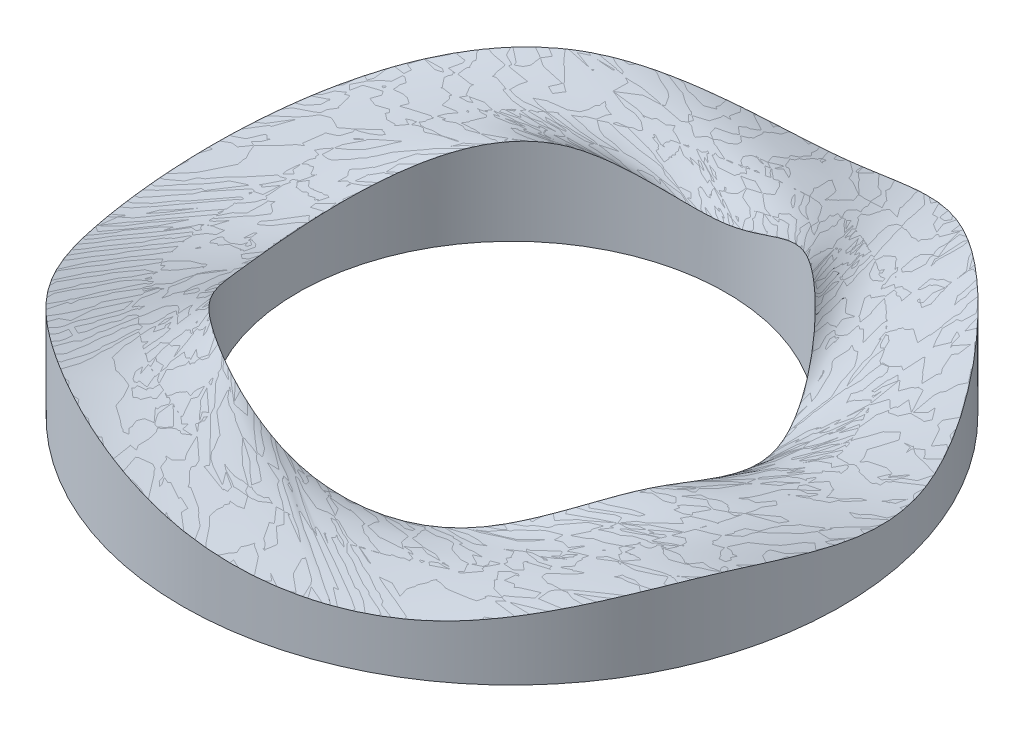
ISO-10303-21;
HEADER;
FILE_DESCRIPTION(('STEP AP214'),'2;1');
FILE_NAME('part.step','',(''),(''),'','','');
FILE_SCHEMA(('AUTOMOTIVE_DESIGN { 1 0 10303 214 1 1 1 1 }'));
ENDSEC;
DATA;
#1=APPLICATION_CONTEXT('core data for automotive mechanical design processes');
#2=APPLICATION_PROTOCOL_DEFINITION('international standard','automotive_design',2000,#1);
#3=PRODUCT_CONTEXT('',#1,'mechanical');
#4=PRODUCT('Part','Part','',(#3));
#5=PRODUCT_RELATED_PRODUCT_CATEGORY('part','',(#4));
#6=PRODUCT_DEFINITION_FORMATION('','',#4);
#7=PRODUCT_DEFINITION_CONTEXT('part definition',#1,'design');
#8=PRODUCT_DEFINITION('design','',#6,#7);
#9=PRODUCT_DEFINITION_SHAPE('','',#8);
#10=(LENGTH_UNIT() NAMED_UNIT(*) SI_UNIT(.MILLI.,.METRE.));
#11=(NAMED_UNIT(*) PLANE_ANGLE_UNIT() SI_UNIT($,.RADIAN.));
#12=(NAMED_UNIT(*) SI_UNIT($,.STERADIAN.) SOLID_ANGLE_UNIT());
#13=UNCERTAINTY_MEASURE_WITH_UNIT(LENGTH_MEASURE(1.E-05),#10,'distance_accuracy_value','');
#14=(GEOMETRIC_REPRESENTATION_CONTEXT(3) GLOBAL_UNCERTAINTY_ASSIGNED_CONTEXT((#13)) GLOBAL_UNIT_ASSIGNED_CONTEXT((#10,
#11,#12)) REPRESENTATION_CONTEXT('',''));
#15=CARTESIAN_POINT('',(0.,0.,0.));
#16=DIRECTION('',(0.,0.,1.));
#17=DIRECTION('',(1.,0.,0.));
#18=AXIS2_PLACEMENT_3D('',#15,#16,#17);
#19=CARTESIAN_POINT('',(20.6727898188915,7.62565812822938,45.4888698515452));
#20=CARTESIAN_POINT('',(-2.46749249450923,10.7919544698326,32.4080531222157));
#21=CARTESIAN_POINT('',(21.8300222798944,7.60634375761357,44.9666345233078));
#22=CARTESIAN_POINT('',(-1.64834188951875,10.5164278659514,32.4710946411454));
#23=CARTESIAN_POINT('',(24.844901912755,7.61870578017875,43.4683421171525));
#24=CARTESIAN_POINT('',(0.533317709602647,9.80945500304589,32.5533657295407));
#25=CARTESIAN_POINT('',(34.6819621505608,8.27213360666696,37.2816772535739));
#26=CARTESIAN_POINT('',(8.11206929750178,7.78317913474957,32.0329687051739));
#27=CARTESIAN_POINT('',(42.9658466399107,11.1822898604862,27.333870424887));
#28=CARTESIAN_POINT('',(16.141990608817,7.13790860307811,28.8949233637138));
#29=CARTESIAN_POINT('',(49.8838387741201,11.1615956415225,10.0609937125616));
#30=CARTESIAN_POINT('',(25.5748112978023,9.55123536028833,21.0436001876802));
#31=CARTESIAN_POINT('',(50.6830927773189,6.7787557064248,-3.11457632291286));
#32=CARTESIAN_POINT('',(30.1747592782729,12.0510626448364,13.7478182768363));
#33=CARTESIAN_POINT('',(46.4089755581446,6.67076836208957,-20.9467694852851));
#34=CARTESIAN_POINT('',(32.94074262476,9.25131690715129,1.825620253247));
#35=CARTESIAN_POINT('',(39.57727854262,13.7160958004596,-32.0585724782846));
#36=CARTESIAN_POINT('',(32.2477583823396,5.32001471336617,-7.11153827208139));
#37=CARTESIAN_POINT('',(25.3925166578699,17.594680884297,-44.152138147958));
#38=CARTESIAN_POINT('',(27.8030693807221,10.0516799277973,-18.1560004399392));
#39=CARTESIAN_POINT('',(12.7636694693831,11.3772509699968,-49.2582258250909));
#40=CARTESIAN_POINT('',(22.3928838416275,16.8949230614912,-24.3476017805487));
#41=CARTESIAN_POINT('',(-6.24347395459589,7.4824546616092,-50.5967759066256));
#42=CARTESIAN_POINT('',(12.2947882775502,15.0008078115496,-30.6259822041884));
#43=CARTESIAN_POINT('',(-18.9783392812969,11.348946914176,-47.2224558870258));
#44=CARTESIAN_POINT('',(4.30372764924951,8.84497790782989,-32.8322977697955));
#45=CARTESIAN_POINT('',(-35.0476665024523,14.0443243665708,-36.9765635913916));
#46=CARTESIAN_POINT('',(-7.94113026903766,8.8108528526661,-32.0950587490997));
#47=CARTESIAN_POINT('',(-43.1439612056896,12.0292683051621,-27.0834561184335));
#48=CARTESIAN_POINT('',(-15.7869922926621,12.931396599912,-29.0968747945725));
#49=CARTESIAN_POINT('',(-50.0340518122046,8.90030939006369,-9.40899715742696));
#50=CARTESIAN_POINT('',(-25.3983105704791,13.4389997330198,-21.2537637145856));
#51=CARTESIAN_POINT('',(-50.723452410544,7.65601653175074,3.46016025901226));
#52=CARTESIAN_POINT('',(-29.9571738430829,10.8785923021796,-14.2305334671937));
#53=CARTESIAN_POINT('',(-46.1227794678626,9.54484475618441,21.5754330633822));
#54=CARTESIAN_POINT('',(-32.9524118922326,8.25395544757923,-2.15909598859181));
#55=CARTESIAN_POINT('',(-39.2989489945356,13.722785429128,32.366580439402));
#56=CARTESIAN_POINT('',(-32.4212478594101,7.71654047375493,6.5409156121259));
#57=CARTESIAN_POINT('',(-24.9438600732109,15.8561567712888,44.3864006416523));
#58=CARTESIAN_POINT('',(-27.9049268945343,11.4307063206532,17.907297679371));
#59=CARTESIAN_POINT('',(-12.7035193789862,12.7751133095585,49.2888596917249));
#60=CARTESIAN_POINT('',(-22.491124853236,15.3898716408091,24.2777014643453));
#61=CARTESIAN_POINT('',(4.85775507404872,8.86531633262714,50.4817965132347));
#62=CARTESIAN_POINT('',(-12.9217654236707,14.7261524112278,30.2705822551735));
#63=CARTESIAN_POINT('',(14.1811903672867,7.73400382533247,48.4183958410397));
#64=CARTESIAN_POINT('',(-7.06259140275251,12.337545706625,32.0544160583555));
#65=CARTESIAN_POINT('',(20.6727898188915,7.62565812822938,45.4888698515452));
#66=CARTESIAN_POINT('',(-2.46749249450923,10.7919544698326,32.4080531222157));
#67=B_SPLINE_SURFACE_WITH_KNOTS('',3,1,((#19,#20),(#21,#22),(#23,#24),(#25,#26),(#27,#28),(#29,
#30),(#31,#32),(#33,#34),(#35,#36),(#37,#38),(#39,#40),(#41,#42),(#43,#44),(#45,#46),(#47,#48),
(#49,#50),(#51,#52),(#53,#54),(#55,#56),(#57,#58),(#59,#60),(#61,#62),(#63,#64),(#65,#66)),
.UNSPECIFIED.,.T.,.F.,.F.,(4,1,1,1,1,1,1,1,1,1,1,1,1,1,1,1,1,1,1,1,1,4),(2,2),(0.,
0.0119794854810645,0.0317498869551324,0.109579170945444,0.130957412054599,0.20777587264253,
0.230524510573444,0.306802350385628,0.333370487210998,0.413225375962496,0.434615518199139,
0.516073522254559,0.534182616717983,0.615099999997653,0.63339014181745,0.713296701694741,
0.732185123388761,0.810536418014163,0.832772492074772,0.911896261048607,0.932800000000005,1.),
(0.,1.),.UNSPECIFIED.);
#68=CARTESIAN_POINT('',(20.6727898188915,7.62565812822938,45.4888698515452));
#69=CARTESIAN_POINT('',(21.8300222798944,7.60634375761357,44.9666345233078));
#70=CARTESIAN_POINT('',(24.844901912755,7.61870578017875,43.4683421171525));
#71=CARTESIAN_POINT('',(34.6819621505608,8.27213360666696,37.2816772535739));
#72=CARTESIAN_POINT('',(42.9658466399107,11.1822898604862,27.333870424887));
#73=CARTESIAN_POINT('',(49.8838387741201,11.1615956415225,10.0609937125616));
#74=CARTESIAN_POINT('',(50.6830927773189,6.7787557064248,-3.11457632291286));
#75=CARTESIAN_POINT('',(46.4089755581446,6.67076836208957,-20.9467694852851));
#76=CARTESIAN_POINT('',(39.57727854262,13.7160958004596,-32.0585724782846));
#77=CARTESIAN_POINT('',(25.3925166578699,17.594680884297,-44.152138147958));
#78=CARTESIAN_POINT('',(12.7636694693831,11.3772509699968,-49.2582258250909));
#79=CARTESIAN_POINT('',(-6.24347395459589,7.4824546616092,-50.5967759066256));
#80=CARTESIAN_POINT('',(-18.9783392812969,11.348946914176,-47.2224558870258));
#81=CARTESIAN_POINT('',(-35.0476665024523,14.0443243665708,-36.9765635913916));
#82=CARTESIAN_POINT('',(-43.1439612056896,12.0292683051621,-27.0834561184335));
#83=CARTESIAN_POINT('',(-50.0340518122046,8.90030939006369,-9.40899715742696));
#84=CARTESIAN_POINT('',(-50.723452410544,7.65601653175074,3.46016025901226));
#85=CARTESIAN_POINT('',(-46.1227794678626,9.54484475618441,21.5754330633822));
#86=CARTESIAN_POINT('',(-39.2989489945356,13.722785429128,32.366580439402));
#87=CARTESIAN_POINT('',(-24.9438600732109,15.8561567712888,44.3864006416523));
#88=CARTESIAN_POINT('',(-12.7035193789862,12.7751133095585,49.2888596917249));
#89=CARTESIAN_POINT('',(4.85775507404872,8.86531633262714,50.4817965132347));
#90=CARTESIAN_POINT('',(14.1811903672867,7.73400382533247,48.4183958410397));
#91=CARTESIAN_POINT('',(20.6727898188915,7.62565812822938,45.4888698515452));
#92=B_SPLINE_CURVE_WITH_KNOTS('',3,(#68,#69,#70,#71,#72,#73,#74,#75,#76,#77,#78,#79,#80,#81,#82,
#83,#84,#85,#86,#87,#88,#89,#90,#91),.UNSPECIFIED.,.T.,.F.,(4,1,1,1,1,1,1,1,1,1,1,1,1,1,1,1,1,1,
1,1,1,4),(0.,0.0119794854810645,0.0317498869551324,0.109579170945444,0.130957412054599,
0.20777587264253,0.230524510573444,0.306802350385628,0.333370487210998,0.413225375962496,
0.434615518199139,0.516073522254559,0.534182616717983,0.615099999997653,0.63339014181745,
0.713296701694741,0.732185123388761,0.810536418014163,0.832772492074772,0.911896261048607,
0.932800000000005,1.),.UNSPECIFIED.);
#93=CARTESIAN_POINT('',(20.6727898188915,7.62565812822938,45.4888698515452));
#94=VERTEX_POINT('',#93);
#95=EDGE_CURVE('E11',#94,#94,#92,.T.);
#96=CARTESIAN_POINT('',(-2.46749249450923,10.7919544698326,32.4080531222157));
#97=CARTESIAN_POINT('',(-1.64834188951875,10.5164278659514,32.4710946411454));
#98=CARTESIAN_POINT('',(0.533317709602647,9.80945500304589,32.5533657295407));
#99=CARTESIAN_POINT('',(8.11206929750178,7.78317913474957,32.0329687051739));
#100=CARTESIAN_POINT('',(16.141990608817,7.13790860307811,28.8949233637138));
#101=CARTESIAN_POINT('',(25.5748112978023,9.55123536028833,21.0436001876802));
#102=CARTESIAN_POINT('',(30.1747592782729,12.0510626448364,13.7478182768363));
#103=CARTESIAN_POINT('',(32.94074262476,9.25131690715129,1.825620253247));
#104=CARTESIAN_POINT('',(32.2477583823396,5.32001471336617,-7.11153827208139));
#105=CARTESIAN_POINT('',(27.8030693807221,10.0516799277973,-18.1560004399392));
#106=CARTESIAN_POINT('',(22.3928838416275,16.8949230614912,-24.3476017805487));
#107=CARTESIAN_POINT('',(12.2947882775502,15.0008078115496,-30.6259822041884));
#108=CARTESIAN_POINT('',(4.30372764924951,8.84497790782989,-32.8322977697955));
#109=CARTESIAN_POINT('',(-7.94113026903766,8.8108528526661,-32.0950587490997));
#110=CARTESIAN_POINT('',(-15.7869922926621,12.931396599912,-29.0968747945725));
#111=CARTESIAN_POINT('',(-25.3983105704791,13.4389997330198,-21.2537637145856));
#112=CARTESIAN_POINT('',(-29.9571738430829,10.8785923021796,-14.2305334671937));
#113=CARTESIAN_POINT('',(-32.9524118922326,8.25395544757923,-2.15909598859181));
#114=CARTESIAN_POINT('',(-32.4212478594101,7.71654047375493,6.5409156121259));
#115=CARTESIAN_POINT('',(-27.9049268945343,11.4307063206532,17.907297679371));
#116=CARTESIAN_POINT('',(-22.491124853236,15.3898716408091,24.2777014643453));
#117=CARTESIAN_POINT('',(-12.9217654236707,14.7261524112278,30.2705822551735));
#118=CARTESIAN_POINT('',(-7.06259140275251,12.337545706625,32.0544160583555));
#119=CARTESIAN_POINT('',(-2.46749249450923,10.7919544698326,32.4080531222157));
#120=B_SPLINE_CURVE_WITH_KNOTS('',3,(#96,#97,#98,#99,#100,#101,#102,#103,#104,#105,#106,#107,
#108,#109,#110,#111,#112,#113,#114,#115,#116,#117,#118,#119),.UNSPECIFIED.,.T.,.F.,(4,1,1,1,1,1,
1,1,1,1,1,1,1,1,1,1,1,1,1,1,1,4),(0.,0.0119794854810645,0.0317498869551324,0.109579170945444,
0.130957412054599,0.20777587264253,0.230524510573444,0.306802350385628,0.333370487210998,
0.413225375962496,0.434615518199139,0.516073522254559,0.534182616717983,0.615099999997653,
0.63339014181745,0.713296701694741,0.732185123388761,0.810536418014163,0.832772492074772,
0.911896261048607,0.932800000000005,1.),.UNSPECIFIED.);
#121=CARTESIAN_POINT('',(-2.46749249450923,10.7919544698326,32.4080531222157));
#122=VERTEX_POINT('',#121);
#123=EDGE_CURVE('E43',#122,#122,#120,.F.);
#124=ORIENTED_EDGE('',*,*,#95,.T.);
#125=EDGE_LOOP('',(#124));
#126=FACE_BOUND('',#125,.T.);
#127=ORIENTED_EDGE('',*,*,#123,.T.);
#128=EDGE_LOOP('',(#127));
#129=FACE_BOUND('',#128,.T.);
#130=ADVANCED_FACE('F40',(#126,#129),#67,.T.);
#131=OPEN_SHELL('',(#130));
#132=SHELL_BASED_SURFACE_MODEL('B2',(#131));
#133=CARTESIAN_POINT('',(0.,20.,0.));
#134=DIRECTION('',(0.,-1.,0.));
#135=DIRECTION('',(0.,0.,-1.));
#136=AXIS2_PLACEMENT_3D('',#133,#134,#135);
#137=CYLINDRICAL_SURFACE('',#136,32.5);
#138=CARTESIAN_POINT('',(0.,0.,0.));
#139=DIRECTION('',(0.,1.,0.));
#140=DIRECTION('',(0.,0.,1.));
#141=AXIS2_PLACEMENT_3D('',#138,#139,#140);
#142=CIRCLE('',#141,32.5);
#143=CARTESIAN_POINT('',(0.,0.,32.5));
#144=VERTEX_POINT('',#143);
#145=EDGE_CURVE('E93',#144,#144,#142,.T.);
#146=ORIENTED_EDGE('',*,*,#145,.F.);
#147=EDGE_LOOP('',(#146));
#148=FACE_BOUND('',#147,.T.);
#149=CARTESIAN_POINT('',(-2.46749249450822,10.7919544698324,32.4080531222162));
#150=CARTESIAN_POINT('',(-7.06259140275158,12.3375457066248,32.0544160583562));
#151=CARTESIAN_POINT('',(-12.9217654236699,14.7261524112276,30.2705822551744));
#152=CARTESIAN_POINT('',(-22.4911248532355,15.389871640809,24.2777014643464));
#153=CARTESIAN_POINT('',(-27.9049268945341,11.4307063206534,17.9072976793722));
#154=CARTESIAN_POINT('',(-32.4212478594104,7.71654047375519,6.54091561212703));
#155=CARTESIAN_POINT('',(-32.9524118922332,8.25395544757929,-2.15909598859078));
#156=CARTESIAN_POINT('',(-29.9571738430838,10.8785923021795,-14.2305334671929));
#157=CARTESIAN_POINT('',(-25.3983105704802,13.4389997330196,-21.253763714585));
#158=CARTESIAN_POINT('',(-15.7869922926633,12.9313965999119,-29.0968747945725));
#159=CARTESIAN_POINT('',(-7.94113026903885,8.81085285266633,-32.0950587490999));
#160=CARTESIAN_POINT('',(4.30372764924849,8.84497790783,-32.8322977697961));
#161=CARTESIAN_POINT('',(12.2947882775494,15.0008078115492,-30.6259822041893));
#162=CARTESIAN_POINT('',(22.3928838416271,16.894923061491,-24.3476017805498));
#163=CARTESIAN_POINT('',(27.803069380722,10.0516799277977,-18.1560004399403));
#164=CARTESIAN_POINT('',(32.2477583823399,5.32001471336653,-7.11153827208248));
#165=CARTESIAN_POINT('',(32.9407426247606,9.25131690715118,1.825620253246));
#166=CARTESIAN_POINT('',(30.1747592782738,12.0510626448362,13.7478182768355));
#167=CARTESIAN_POINT('',(25.5748112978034,9.55123536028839,21.0436001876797));
#168=CARTESIAN_POINT('',(16.1419906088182,7.13790860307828,28.8949233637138));
#169=CARTESIAN_POINT('',(8.11206929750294,7.78317913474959,32.0329687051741));
#170=CARTESIAN_POINT('',(0.533317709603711,9.80945500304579,32.5533657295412));
#171=CARTESIAN_POINT('',(-1.64834188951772,10.5164278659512,32.4710946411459));
#172=CARTESIAN_POINT('',(-2.46749249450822,10.7919544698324,32.4080531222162));
#173=B_SPLINE_CURVE_WITH_KNOTS('',3,(#149,#150,#151,#152,#153,#154,#155,#156,#157,#158,#159,
#160,#161,#162,#163,#164,#165,#166,#167,#168,#169,#170,#171,#172),.UNSPECIFIED.,.T.,.F.,(4,1,1,
1,1,1,1,1,1,1,1,1,1,1,1,1,1,1,1,1,1,4),(0.,0.0671999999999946,0.0881037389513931,
0.167227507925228,0.189463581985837,0.267814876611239,0.286703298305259,0.36660985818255,
0.384900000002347,0.465817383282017,0.483926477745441,0.565384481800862,0.586774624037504,
0.666629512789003,0.693197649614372,0.769475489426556,0.79222412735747,0.869042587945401,
0.890420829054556,0.968250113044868,0.988020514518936,1.),.UNSPECIFIED.);
#174=CARTESIAN_POINT('',(-30.9093367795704,10.0000000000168,-10.0430523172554));
#175=VERTEX_POINT('',#174);
#176=CARTESIAN_POINT('',(-19.1030206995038,12.9999999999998,-26.293052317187));
#177=VERTEX_POINT('',#176);
#178=EDGE_CURVE('E250',#175,#177,#173,.T.);
#179=ORIENTED_EDGE('',*,*,#178,.F.);
#180=CARTESIAN_POINT('',(-30.9093367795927,8.99999999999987,10.0430523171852));
#181=CARTESIAN_POINT('',(-30.97374949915,8.95406336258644,9.84481337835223));
#182=CARTESIAN_POINT('',(-31.0364098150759,8.91048992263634,9.64547163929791));
#183=CARTESIAN_POINT('',(-31.1581226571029,8.82799201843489,9.24474092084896));
#184=CARTESIAN_POINT('',(-31.2171752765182,8.78906743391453,9.04335199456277));
#185=CARTESIAN_POINT('',(-31.3886397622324,8.67923216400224,8.4368042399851));
#186=CARTESIAN_POINT('',(-31.4955076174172,8.61515414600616,8.02880545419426));
#187=CARTESIAN_POINT('',(-31.6936799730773,8.50441802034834,7.20689510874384));
#188=CARTESIAN_POINT('',(-31.7849896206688,8.45775414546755,6.7929855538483));
#189=CARTESIAN_POINT('',(-31.9511798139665,8.38095386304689,5.96243329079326));
#190=CARTESIAN_POINT('',(-32.026136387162,8.35073995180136,5.545812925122));
#191=CARTESIAN_POINT('',(-32.1598238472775,8.30540039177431,4.70906439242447));
#192=CARTESIAN_POINT('',(-32.2185505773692,8.29027860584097,4.28893535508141));
#193=CARTESIAN_POINT('',(-32.319537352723,8.27403500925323,3.44638663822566));
#194=CARTESIAN_POINT('',(-32.3617948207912,8.27291538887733,3.02396661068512));
#195=CARTESIAN_POINT('',(-32.437362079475,8.28482954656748,2.08273174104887));
#196=CARTESIAN_POINT('',(-32.4665175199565,8.30110548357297,1.56361924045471));
#197=CARTESIAN_POINT('',(-32.4999042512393,8.35128712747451,0.525409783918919));
#198=CARTESIAN_POINT('',(-32.5041321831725,8.38519520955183,0.00631283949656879));
#199=CARTESIAN_POINT('',(-32.4878023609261,8.46901082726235,-1.03024849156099));
#200=CARTESIAN_POINT('',(-32.4672415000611,8.51892036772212,-1.54771266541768));
#201=CARTESIAN_POINT('',(-32.4015504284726,8.63333474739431,-2.58022076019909));
#202=CARTESIAN_POINT('',(-32.3563838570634,8.69786110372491,-3.09525995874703));
#203=CARTESIAN_POINT('',(-32.2418340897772,8.84008119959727,-4.12071108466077));
#204=CARTESIAN_POINT('',(-32.1724547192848,8.91777285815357,-4.63112372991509));
#205=CARTESIAN_POINT('',(-32.0099508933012,9.08501065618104,-5.64597750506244));
#206=CARTESIAN_POINT('',(-31.9168352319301,9.17455239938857,-6.15042077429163));
#207=CARTESIAN_POINT('',(-31.6915595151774,9.37855327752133,-7.22784643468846));
#208=CARTESIAN_POINT('',(-31.5556321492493,9.49473429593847,-7.7997165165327));
#209=CARTESIAN_POINT('',(-31.2543371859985,9.73891034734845,-8.93072743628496));
#210=CARTESIAN_POINT('',(-31.0890804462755,9.86686004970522,-9.48990756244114));
#211=CARTESIAN_POINT('',(-30.9093367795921,10.0000000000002,-10.0430523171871));
#212=B_SPLINE_CURVE_WITH_KNOTS('',3,(#180,#181,#182,#183,#184,#185,#186,#187,#188,#189,#190,
#191,#192,#193,#194,#195,#196,#197,#198,#199,#200,#201,#202,#203,#204,#205,#206,#207,#208,#209,
#210,#211),.UNSPECIFIED.,.F.,.F.,(4,2,2,2,2,2,2,2,2,2,2,2,2,2,2,4),(0.,0.640279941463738,
1.28054331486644,2.559589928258,3.83821257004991,5.1107576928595,6.3836284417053,
7.65669829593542,9.21629255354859,10.7760969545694,12.3360968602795,13.8984083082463,
15.4604730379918,17.0219598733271,18.8184819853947,20.6083529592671),.UNSPECIFIED.);
#213=CARTESIAN_POINT('',(-30.9093367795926,8.99999999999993,10.0430523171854));
#214=VERTEX_POINT('',#213);
#215=EDGE_CURVE('E192',#214,#175,#212,.T.);
#216=ORIENTED_EDGE('',*,*,#215,.F.);
#217=CARTESIAN_POINT('',(-2.46749249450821,10.7919544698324,32.4080531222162));
#218=CARTESIAN_POINT('',(-7.06259140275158,12.3375457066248,32.0544160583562));
#219=CARTESIAN_POINT('',(-12.9217654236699,14.7261524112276,30.2705822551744));
#220=CARTESIAN_POINT('',(-22.4911248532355,15.389871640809,24.2777014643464));
#221=CARTESIAN_POINT('',(-27.9049268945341,11.4307063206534,17.9072976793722));
#222=CARTESIAN_POINT('',(-32.4212478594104,7.71654047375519,6.54091561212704));
#223=CARTESIAN_POINT('',(-32.9524118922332,8.25395544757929,-2.15909598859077));
#224=CARTESIAN_POINT('',(-29.9571738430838,10.8785923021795,-14.2305334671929));
#225=CARTESIAN_POINT('',(-25.3983105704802,13.4389997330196,-21.253763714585));
#226=CARTESIAN_POINT('',(-15.7869922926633,12.9313965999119,-29.0968747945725));
#227=CARTESIAN_POINT('',(-7.94113026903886,8.81085285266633,-32.0950587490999));
#228=CARTESIAN_POINT('',(4.30372764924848,8.84497790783,-32.8322977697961));
#229=CARTESIAN_POINT('',(12.2947882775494,15.0008078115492,-30.6259822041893));
#230=CARTESIAN_POINT('',(22.3928838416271,16.894923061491,-24.3476017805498));
#231=CARTESIAN_POINT('',(27.803069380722,10.0516799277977,-18.1560004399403));
#232=CARTESIAN_POINT('',(32.2477583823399,5.32001471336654,-7.11153827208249));
#233=CARTESIAN_POINT('',(32.9407426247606,9.25131690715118,1.825620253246));
#234=CARTESIAN_POINT('',(30.1747592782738,12.0510626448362,13.7478182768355));
#235=CARTESIAN_POINT('',(25.5748112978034,9.5512353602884,21.0436001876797));
#236=CARTESIAN_POINT('',(16.1419906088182,7.13790860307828,28.8949233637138));
#237=CARTESIAN_POINT('',(8.11206929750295,7.78317913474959,32.0329687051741));
#238=CARTESIAN_POINT('',(0.533317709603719,9.80945500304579,32.5533657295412));
#239=CARTESIAN_POINT('',(-1.64834188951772,10.5164278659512,32.471094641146));
#240=CARTESIAN_POINT('',(-2.46749249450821,10.7919544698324,32.4080531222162));
#241=B_SPLINE_CURVE_WITH_KNOTS('',3,(#217,#218,#219,#220,#221,#222,#223,#224,#225,#226,#227,
#228,#229,#230,#231,#232,#233,#234,#235,#236,#237,#238,#239,#240),.UNSPECIFIED.,.T.,.F.,(4,1,1,
1,1,1,1,1,1,1,1,1,1,1,1,1,1,1,1,1,1,4),(0.,0.0671999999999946,0.0881037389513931,
0.167227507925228,0.189463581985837,0.267814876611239,0.286703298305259,0.36660985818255,
0.384900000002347,0.465817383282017,0.483926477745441,0.565384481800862,0.586774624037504,
0.666629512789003,0.693197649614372,0.769475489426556,0.79222412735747,0.869042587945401,
0.890420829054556,0.968250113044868,0.988020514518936,1.),.UNSPECIFIED.);
#242=CARTESIAN_POINT('',(-19.1030206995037,15.0000000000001,26.293052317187));
#243=VERTEX_POINT('',#242);
#244=EDGE_CURVE('E181',#243,#214,#241,.T.);
#245=ORIENTED_EDGE('',*,*,#244,.F.);
#246=CARTESIAN_POINT('',(30.9093367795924,11.,10.0430523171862));
#247=CARTESIAN_POINT('',(30.8267576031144,11.0294895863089,10.2972296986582));
#248=CARTESIAN_POINT('',(30.7408552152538,11.0537055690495,10.5509181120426));
#249=CARTESIAN_POINT('',(30.5625693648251,11.092022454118,11.0567225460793));
#250=CARTESIAN_POINT('',(30.4701872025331,11.1061253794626,11.3088388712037));
#251=CARTESIAN_POINT('',(30.2792542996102,11.1246422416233,11.8105330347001));
#252=CARTESIAN_POINT('',(30.1807155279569,11.1290744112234,12.0601147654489));
#253=CARTESIAN_POINT('',(29.9774913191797,11.1288657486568,12.5567523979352));
#254=CARTESIAN_POINT('',(29.8728055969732,11.1242244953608,12.8038081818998));
#255=CARTESIAN_POINT('',(29.5522633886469,11.0978107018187,13.5349390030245));
#256=CARTESIAN_POINT('',(29.3276975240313,11.0637329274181,14.0148154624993));
#257=CARTESIAN_POINT('',(28.8565406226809,10.9678105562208,14.9609404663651));
#258=CARTESIAN_POINT('',(28.6099367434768,10.9059496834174,15.4271808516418));
#259=CARTESIAN_POINT('',(28.0800251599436,10.7554987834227,16.3729651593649));
#260=CARTESIAN_POINT('',(27.7953888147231,10.6654863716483,16.851534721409));
#261=CARTESIAN_POINT('',(27.2037724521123,10.46688811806,17.7908130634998));
#262=CARTESIAN_POINT('',(26.896784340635,10.358295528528,18.2515152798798));
#263=CARTESIAN_POINT('',(26.2612388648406,10.1286670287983,19.1546950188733));
#264=CARTESIAN_POINT('',(25.932676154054,10.0076280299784,19.59716797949));
#265=CARTESIAN_POINT('',(25.2525704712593,9.75819868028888,20.4661636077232));
#266=CARTESIAN_POINT('',(24.9009074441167,9.6297704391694,20.8925812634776));
#267=CARTESIAN_POINT('',(24.1766035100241,9.37186049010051,21.7266387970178));
#268=CARTESIAN_POINT('',(23.8039686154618,9.24237909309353,22.1342839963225));
#269=CARTESIAN_POINT('',(23.0376306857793,8.98785894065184,22.9308308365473));
#270=CARTESIAN_POINT('',(22.6439264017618,8.86282044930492,23.319731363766));
#271=CARTESIAN_POINT('',(21.9735941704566,8.6638519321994,23.9487858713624));
#272=CARTESIAN_POINT('',(21.7029033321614,8.5870515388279,24.1943792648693));
#273=CARTESIAN_POINT('',(21.1524490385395,8.43951666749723,24.6770722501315));
#274=CARTESIAN_POINT('',(20.8726859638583,8.36878193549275,24.9141721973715));
#275=CARTESIAN_POINT('',(20.3042189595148,8.23514255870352,25.3795898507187));
#276=CARTESIAN_POINT('',(20.015517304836,8.17223594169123,25.6079097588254));
#277=CARTESIAN_POINT('',(19.5758789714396,8.08509886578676,25.9435725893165));
#278=CARTESIAN_POINT('',(19.4282406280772,8.05725785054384,26.0543201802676));
#279=CARTESIAN_POINT('',(19.1307847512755,8.00424108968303,26.2735076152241));
#280=CARTESIAN_POINT('',(18.9809672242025,7.97906533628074,26.381947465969));
#281=CARTESIAN_POINT('',(18.6797174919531,7.93154591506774,26.5960935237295));
#282=CARTESIAN_POINT('',(18.5282924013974,7.90919301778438,26.7018076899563));
#283=CARTESIAN_POINT('',(18.2234085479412,7.86718741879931,26.9108072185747));
#284=CARTESIAN_POINT('',(18.0699497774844,7.84753472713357,27.0140925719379));
#285=CARTESIAN_POINT('',(17.6065426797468,7.79259811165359,27.3202625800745));
#286=CARTESIAN_POINT('',(17.2936275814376,7.76134572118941,27.5194156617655));
#287=CARTESIAN_POINT('',(16.6604840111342,7.70938000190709,27.9072774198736));
#288=CARTESIAN_POINT('',(16.3402544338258,7.68866827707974,28.0959845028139));
#289=CARTESIAN_POINT('',(15.6931407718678,7.65751819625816,28.4624948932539));
#290=CARTESIAN_POINT('',(15.3662567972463,7.64707967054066,28.6402983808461));
#291=CARTESIAN_POINT('',(14.5956754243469,7.63433770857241,29.0424389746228));
#292=CARTESIAN_POINT('',(14.1495974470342,7.63594094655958,29.2623630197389));
#293=CARTESIAN_POINT('',(13.2481904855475,7.65615160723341,29.6813492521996));
#294=CARTESIAN_POINT('',(12.7928621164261,7.67475790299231,29.8804128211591));
#295=CARTESIAN_POINT('',(11.8743788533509,7.72819728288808,30.257156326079));
#296=CARTESIAN_POINT('',(11.4112238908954,7.76303050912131,30.4348360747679));
#297=CARTESIAN_POINT('',(10.4778178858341,7.84825283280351,30.7686756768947));
#298=CARTESIAN_POINT('',(10.0075568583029,7.89866622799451,30.9248013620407));
#299=CARTESIAN_POINT('',(9.06208805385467,8.0143396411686,31.21494954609));
#300=CARTESIAN_POINT('',(8.58688040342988,8.07959928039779,31.3489726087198));
#301=CARTESIAN_POINT('',(7.63297824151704,8.22431612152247,31.5947815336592));
#302=CARTESIAN_POINT('',(7.15428422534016,8.30377134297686,31.7065704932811));
#303=CARTESIAN_POINT('',(6.11867836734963,8.48996072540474,31.9238819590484));
#304=CARTESIAN_POINT('',(5.56138454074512,8.59902220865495,32.0256087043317));
#305=CARTESIAN_POINT('',(4.44595927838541,8.834532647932,32.1994103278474));
#306=CARTESIAN_POINT('',(3.88782797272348,8.96097913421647,32.2714894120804));
#307=CARTESIAN_POINT('',(2.77296384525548,9.23036466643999,32.386331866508));
#308=CARTESIAN_POINT('',(2.21623031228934,9.37329195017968,32.4291159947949));
#309=CARTESIAN_POINT('',(1.10557172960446,9.67496169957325,32.4859487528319));
#310=CARTESIAN_POINT('',(0.55164684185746,9.83370506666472,32.4999957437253));
#311=CARTESIAN_POINT('',(-0.634463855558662,10.1912602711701,32.5000048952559));
#312=CARTESIAN_POINT('',(-1.26591433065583,10.3925096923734,32.4814341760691));
#313=CARTESIAN_POINT('',(-2.52287854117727,10.8075647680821,32.4080491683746));
#314=CARTESIAN_POINT('',(-3.14838854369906,11.021377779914,32.353213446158));
#315=CARTESIAN_POINT('',(-4.39372588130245,11.4543719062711,32.2077384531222));
#316=CARTESIAN_POINT('',(-5.01354991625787,11.6735558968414,32.1170795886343));
#317=CARTESIAN_POINT('',(-6.24910777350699,12.1107123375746,31.8997349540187));
#318=CARTESIAN_POINT('',(-6.86482726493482,12.3286803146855,31.772958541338));
#319=CARTESIAN_POINT('',(-8.09047467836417,12.7556304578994,31.4831790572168));
#320=CARTESIAN_POINT('',(-8.70040551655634,12.9646173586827,31.320195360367));
#321=CARTESIAN_POINT('',(-9.91435097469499,13.3662495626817,30.9573354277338));
#322=CARTESIAN_POINT('',(-10.5183689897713,13.5589047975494,30.7574818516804));
#323=CARTESIAN_POINT('',(-11.4689143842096,13.8445519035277,30.4113886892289));
#324=CARTESIAN_POINT('',(-11.8176108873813,13.9455600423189,30.2776235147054));
#325=CARTESIAN_POINT('',(-12.5125185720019,14.1376476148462,29.9971207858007));
#326=CARTESIAN_POINT('',(-12.8587299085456,14.2287276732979,29.850384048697));
#327=CARTESIAN_POINT('',(-13.5482934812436,14.3991532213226,29.5438001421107));
#328=CARTESIAN_POINT('',(-13.8916453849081,14.4784973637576,29.383951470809));
#329=CARTESIAN_POINT('',(-14.5729298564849,14.6230865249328,29.0520644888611));
#330=CARTESIAN_POINT('',(-14.9108821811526,14.6884095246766,28.880101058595));
#331=CARTESIAN_POINT('',(-15.5826116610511,14.8035161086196,28.5232684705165));
#332=CARTESIAN_POINT('',(-15.9163889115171,14.8533000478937,28.3383996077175));
#333=CARTESIAN_POINT('',(-16.5788370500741,14.9352430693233,27.9560076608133));
#334=CARTESIAN_POINT('',(-16.9075083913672,14.9674037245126,27.7584857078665));
#335=CARTESIAN_POINT('',(-17.4804929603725,15.0066639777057,27.4001384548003));
#336=CARTESIAN_POINT('',(-17.7261306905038,15.0179244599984,27.2418752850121));
#337=CARTESIAN_POINT('',(-18.2132754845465,15.0281667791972,26.9186184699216));
#338=CARTESIAN_POINT('',(-18.4547821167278,15.0271473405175,26.7536241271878));
#339=CARTESIAN_POINT('',(-18.8133944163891,15.0157955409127,26.5014633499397));
#340=CARTESIAN_POINT('',(-18.93232082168,15.0103747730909,26.4166338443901));
#341=CARTESIAN_POINT('',(-19.1688869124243,14.9961512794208,26.2454774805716));
#342=CARTESIAN_POINT('',(-19.2865266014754,14.9873485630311,26.1591506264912));
#343=CARTESIAN_POINT('',(-19.6373469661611,14.9560296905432,25.8980609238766));
#344=CARTESIAN_POINT('',(-19.8685013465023,14.9286004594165,25.7211380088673));
#345=CARTESIAN_POINT('',(-20.3257301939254,14.8616295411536,25.3613810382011));
#346=CARTESIAN_POINT('',(-20.551782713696,14.8220434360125,25.1785275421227));
#347=CARTESIAN_POINT('',(-20.997668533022,14.7319183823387,24.8079016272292));
#348=CARTESIAN_POINT('',(-21.2175002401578,14.6813766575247,24.6201279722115));
#349=CARTESIAN_POINT('',(-21.650757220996,14.5704679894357,24.240004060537));
#350=CARTESIAN_POINT('',(-21.8641802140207,14.5100975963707,24.0476522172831));
#351=CARTESIAN_POINT('',(-22.2844388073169,14.3806573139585,23.6587355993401));
#352=CARTESIAN_POINT('',(-22.4912740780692,14.3115869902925,23.462170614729));
#353=CARTESIAN_POINT('',(-23.0869224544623,14.098288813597,22.8810855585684));
#354=CARTESIAN_POINT('',(-23.4667990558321,13.9437152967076,22.4911491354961));
#355=CARTESIAN_POINT('',(-24.2023384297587,13.6134270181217,21.6976880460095));
#356=CARTESIAN_POINT('',(-24.5579959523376,13.4377076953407,21.2941604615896));
#357=CARTESIAN_POINT('',(-25.245902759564,13.0715269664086,20.4739095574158));
#358=CARTESIAN_POINT('',(-25.5781456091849,12.8810615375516,20.0571826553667));
#359=CARTESIAN_POINT('',(-26.220273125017,12.491120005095,19.2101551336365));
#360=CARTESIAN_POINT('',(-26.5301329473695,12.291634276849,18.7798401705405));
#361=CARTESIAN_POINT('',(-27.1277095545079,11.8894919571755,17.9057965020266));
#362=CARTESIAN_POINT('',(-27.4154336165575,11.6868364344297,17.4620722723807));
#363=CARTESIAN_POINT('',(-27.9693152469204,11.2837701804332,16.5604143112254));
#364=CARTESIAN_POINT('',(-28.2354752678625,11.0833591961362,16.1024822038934));
#365=CARTESIAN_POINT('',(-28.6513612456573,10.7634788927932,15.344726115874));
#366=CARTESIAN_POINT('',(-28.8075718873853,10.6416300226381,15.0494485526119));
#367=CARTESIAN_POINT('',(-29.1114877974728,10.4025026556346,14.4527975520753));
#368=CARTESIAN_POINT('',(-29.2591947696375,10.2852232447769,14.1514253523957));
#369=CARTESIAN_POINT('',(-29.5459847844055,10.0567696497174,13.5424522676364));
#370=CARTESIAN_POINT('',(-29.6850706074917,9.94559349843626,13.2348534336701));
#371=CARTESIAN_POINT('',(-29.954240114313,9.73111508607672,12.6137948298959));
#372=CARTESIAN_POINT('',(-30.0843404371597,9.62779823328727,12.3003473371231));
#373=CARTESIAN_POINT('',(-30.3356328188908,9.43046085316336,11.666855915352));
#374=CARTESIAN_POINT('',(-30.456821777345,9.33644355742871,11.3468097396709));
#375=CARTESIAN_POINT('',(-30.6900664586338,9.15944231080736,10.6999147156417));
#376=CARTESIAN_POINT('',(-30.8021102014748,9.07647274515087,10.3730576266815));
#377=CARTESIAN_POINT('',(-30.9093367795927,8.99999999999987,10.0430523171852));
#378=B_SPLINE_CURVE_WITH_KNOTS('',3,(#246,#247,#248,#249,#250,#251,#252,#253,#254,#255,#256,
#257,#258,#259,#260,#261,#262,#263,#264,#265,#266,#267,#268,#269,#270,#271,#272,#273,#274,#275,
#276,#277,#278,#279,#280,#281,#282,#283,#284,#285,#286,#287,#288,#289,#290,#291,#292,#293,#294,
#295,#296,#297,#298,#299,#300,#301,#302,#303,#304,#305,#306,#307,#308,#309,#310,#311,#312,#313,
#314,#315,#316,#317,#318,#319,#320,#321,#322,#323,#324,#325,#326,#327,#328,#329,#330,#331,#332,
#333,#334,#335,#336,#337,#338,#339,#340,#341,#342,#343,#344,#345,#346,#347,#348,#349,#350,#351,
#352,#353,#354,#355,#356,#357,#358,#359,#360,#361,#362,#363,#364,#365,#366,#367,#368,#369,#370,
#371,#372,#373,#374,#375,#376,#377),.UNSPECIFIED.,.F.,.F.,(4,2,2,2,2,2,2,2,2,2,2,2,2,2,2,2,2,2,
2,2,2,2,2,2,2,2,2,2,2,2,2,2,2,2,2,2,2,2,2,2,2,2,2,2,2,2,2,2,2,2,2,2,2,2,2,2,2,2,2,2,2,2,2,2,2,
4),(0.,0.806530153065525,1.61289892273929,2.4177460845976,3.2226306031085,4.8137053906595,
6.40571348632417,8.09667432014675,9.78825056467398,11.4802475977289,13.1818663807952,
14.8829997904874,16.5842341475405,17.7044521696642,18.8246232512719,19.9445115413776,
20.5044155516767,21.0643179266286,21.622339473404,22.1803630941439,23.2966477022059,
24.4131021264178,25.5295381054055,27.0207144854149,28.511792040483,30.0028826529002,
31.4963105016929,32.989700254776,34.4828818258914,36.2125227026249,37.9419181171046,
39.6700868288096,41.398354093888,43.3860807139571,45.3749831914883,47.3649750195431,
49.3600057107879,51.3539714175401,53.3467157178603,54.5070931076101,55.6673974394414,
56.8278348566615,57.9816407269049,59.135420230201,60.2890967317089,61.1660485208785,
62.043091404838,62.4815897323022,62.9200868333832,63.7968157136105,64.6767868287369,
65.5569812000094,66.4374851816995,67.318033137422,69.0143698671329,70.7110731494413,
72.4082409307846,74.1072644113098,75.8057269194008,77.5039959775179,78.5705818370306,
79.6369532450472,80.7029789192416,81.7669744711,82.8313384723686,83.8970751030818),.UNSPECIFIED.);
#379=CARTESIAN_POINT('',(-3.76188207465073,11.2346849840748,32.2815464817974));
#380=VERTEX_POINT('',#379);
#381=EDGE_CURVE('E178',#380,#243,#378,.T.);
#382=ORIENTED_EDGE('',*,*,#381,.F.);
#383=CARTESIAN_POINT('',(-2.46749249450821,10.7919544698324,32.4080531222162));
#384=CARTESIAN_POINT('',(-7.06259140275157,12.3375457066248,32.0544160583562));
#385=CARTESIAN_POINT('',(-12.9217654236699,14.7261524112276,30.2705822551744));
#386=CARTESIAN_POINT('',(-22.4911248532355,15.389871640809,24.2777014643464));
#387=CARTESIAN_POINT('',(-27.9049268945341,11.4307063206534,17.9072976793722));
#388=CARTESIAN_POINT('',(-32.4212478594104,7.71654047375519,6.54091561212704));
#389=CARTESIAN_POINT('',(-32.9524118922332,8.25395544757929,-2.15909598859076));
#390=CARTESIAN_POINT('',(-29.9571738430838,10.8785923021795,-14.2305334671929));
#391=CARTESIAN_POINT('',(-25.3983105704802,13.4389997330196,-21.253763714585));
#392=CARTESIAN_POINT('',(-15.7869922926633,12.9313965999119,-29.0968747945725));
#393=CARTESIAN_POINT('',(-7.94113026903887,8.81085285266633,-32.0950587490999));
#394=CARTESIAN_POINT('',(4.30372764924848,8.84497790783,-32.8322977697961));
#395=CARTESIAN_POINT('',(12.2947882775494,15.0008078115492,-30.6259822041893));
#396=CARTESIAN_POINT('',(22.3928838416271,16.894923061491,-24.3476017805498));
#397=CARTESIAN_POINT('',(27.803069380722,10.0516799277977,-18.1560004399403));
#398=CARTESIAN_POINT('',(32.2477583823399,5.32001471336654,-7.1115382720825));
#399=CARTESIAN_POINT('',(32.9407426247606,9.25131690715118,1.82562025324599));
#400=CARTESIAN_POINT('',(30.1747592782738,12.0510626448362,13.7478182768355));
#401=CARTESIAN_POINT('',(25.5748112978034,9.5512353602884,21.0436001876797));
#402=CARTESIAN_POINT('',(16.1419906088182,7.13790860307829,28.8949233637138));
#403=CARTESIAN_POINT('',(8.11206929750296,7.78317913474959,32.0329687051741));
#404=CARTESIAN_POINT('',(0.533317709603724,9.80945500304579,32.5533657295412));
#405=CARTESIAN_POINT('',(-1.64834188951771,10.5164278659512,32.471094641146));
#406=CARTESIAN_POINT('',(-2.4674924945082,10.7919544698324,32.4080531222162));
#407=B_SPLINE_CURVE_WITH_KNOTS('',3,(#383,#384,#385,#386,#387,#388,#389,#390,#391,#392,#393,
#394,#395,#396,#397,#398,#399,#400,#401,#402,#403,#404,#405,#406),.UNSPECIFIED.,.T.,.F.,(4,1,1,
1,1,1,1,1,1,1,1,1,1,1,1,1,1,1,1,1,1,4),(0.,0.0671999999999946,0.0881037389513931,
0.167227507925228,0.189463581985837,0.267814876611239,0.286703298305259,0.36660985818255,
0.384900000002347,0.465817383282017,0.483926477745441,0.565384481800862,0.586774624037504,
0.666629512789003,0.693197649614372,0.769475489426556,0.79222412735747,0.869042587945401,
0.890420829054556,0.968250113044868,0.988020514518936,1.),.UNSPECIFIED.);
#408=CARTESIAN_POINT('',(6.14232788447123E-13,9.99999999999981,32.5));
#409=VERTEX_POINT('',#408);
#410=EDGE_CURVE('E185',#409,#380,#407,.T.);
#411=ORIENTED_EDGE('',*,*,#410,.F.);
#412=CARTESIAN_POINT('',(19.1030206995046,7.99999999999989,26.2930523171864));
#413=VERTEX_POINT('',#412);
#414=EDGE_CURVE('E389',#413,#409,#378,.T.);
#415=ORIENTED_EDGE('',*,*,#414,.F.);
#416=CARTESIAN_POINT('',(-2.46749249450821,10.7919544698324,32.4080531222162));
#417=CARTESIAN_POINT('',(-7.06259140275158,12.3375457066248,32.0544160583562));
#418=CARTESIAN_POINT('',(-12.9217654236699,14.7261524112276,30.2705822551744));
#419=CARTESIAN_POINT('',(-22.4911248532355,15.389871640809,24.2777014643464));
#420=CARTESIAN_POINT('',(-27.9049268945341,11.4307063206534,17.9072976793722));
#421=CARTESIAN_POINT('',(-32.4212478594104,7.71654047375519,6.54091561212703));
#422=CARTESIAN_POINT('',(-32.9524118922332,8.25395544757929,-2.15909598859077));
#423=CARTESIAN_POINT('',(-29.9571738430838,10.8785923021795,-14.2305334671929));
#424=CARTESIAN_POINT('',(-25.3983105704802,13.4389997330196,-21.253763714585));
#425=CARTESIAN_POINT('',(-15.7869922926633,12.9313965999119,-29.0968747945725));
#426=CARTESIAN_POINT('',(-7.94113026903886,8.81085285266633,-32.0950587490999));
#427=CARTESIAN_POINT('',(4.30372764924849,8.84497790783,-32.8322977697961));
#428=CARTESIAN_POINT('',(12.2947882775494,15.0008078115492,-30.6259822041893));
#429=CARTESIAN_POINT('',(22.3928838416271,16.894923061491,-24.3476017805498));
#430=CARTESIAN_POINT('',(27.803069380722,10.0516799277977,-18.1560004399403));
#431=CARTESIAN_POINT('',(32.2477583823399,5.32001471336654,-7.11153827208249));
#432=CARTESIAN_POINT('',(32.9407426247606,9.25131690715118,1.825620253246));
#433=CARTESIAN_POINT('',(30.1747592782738,12.0510626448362,13.7478182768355));
#434=CARTESIAN_POINT('',(25.5748112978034,9.5512353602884,21.0436001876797));
#435=CARTESIAN_POINT('',(16.1419906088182,7.13790860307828,28.8949233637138));
#436=CARTESIAN_POINT('',(8.11206929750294,7.78317913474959,32.0329687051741));
#437=CARTESIAN_POINT('',(0.533317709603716,9.80945500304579,32.5533657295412));
#438=CARTESIAN_POINT('',(-1.64834188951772,10.5164278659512,32.4710946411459));
#439=CARTESIAN_POINT('',(-2.46749249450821,10.7919544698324,32.4080531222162));
#440=B_SPLINE_CURVE_WITH_KNOTS('',3,(#416,#417,#418,#419,#420,#421,#422,#423,#424,#425,#426,
#427,#428,#429,#430,#431,#432,#433,#434,#435,#436,#437,#438,#439),.UNSPECIFIED.,.T.,.F.,(4,1,1,
1,1,1,1,1,1,1,1,1,1,1,1,1,1,1,1,1,1,4),(0.,0.0671999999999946,0.0881037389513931,
0.167227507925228,0.189463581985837,0.267814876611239,0.286703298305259,0.36660985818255,
0.384900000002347,0.465817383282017,0.483926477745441,0.565384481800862,0.586774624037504,
0.666629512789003,0.693197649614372,0.769475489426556,0.79222412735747,0.869042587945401,
0.890420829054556,0.968250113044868,0.988020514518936,1.),.UNSPECIFIED.);
#441=CARTESIAN_POINT('',(30.9093367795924,11.,10.0430523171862));
#442=VERTEX_POINT('',#441);
#443=EDGE_CURVE('E110',#442,#413,#440,.T.);
#444=ORIENTED_EDGE('',*,*,#443,.F.);
#445=CARTESIAN_POINT('',(30.9093367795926,6.99999999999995,-10.0430523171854));
#446=CARTESIAN_POINT('',(30.9711794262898,6.96730499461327,-9.85274479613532));
#447=CARTESIAN_POINT('',(31.0315093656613,6.93995250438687,-9.66106431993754));
#448=CARTESIAN_POINT('',(31.148816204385,6.89540223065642,-9.27586026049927));
#449=CARTESIAN_POINT('',(31.2057985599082,6.87818748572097,-9.08234030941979));
#450=CARTESIAN_POINT('',(31.3162639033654,6.85328275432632,-8.69381521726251));
#451=CARTESIAN_POINT('',(31.3697486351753,6.84558798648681,-8.4988108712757));
#452=CARTESIAN_POINT('',(31.4724125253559,6.83906238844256,-8.1103067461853));
#453=CARTESIAN_POINT('',(31.521639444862,6.8401151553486,-7.91682139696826));
#454=CARTESIAN_POINT('',(31.6164915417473,6.850111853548,-7.52909766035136));
#455=CARTESIAN_POINT('',(31.6621152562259,6.85905897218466,-7.33485900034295));
#456=CARTESIAN_POINT('',(31.7496923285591,6.8841364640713,-6.9459903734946));
#457=CARTESIAN_POINT('',(31.791644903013,6.90026836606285,-6.75136033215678));
#458=CARTESIAN_POINT('',(31.9103654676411,6.95761388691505,-6.17497912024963));
#459=CARTESIAN_POINT('',(31.9818750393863,7.00803650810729,-5.79303502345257));
#460=CARTESIAN_POINT('',(32.1107654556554,7.12880438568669,-5.02978506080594));
#461=CARTESIAN_POINT('',(32.1681371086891,7.19916253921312,-4.64847976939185));
#462=CARTESIAN_POINT('',(32.2689854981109,7.35543258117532,-3.88716491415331));
#463=CARTESIAN_POINT('',(32.3124587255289,7.44134838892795,-3.50715570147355));
#464=CARTESIAN_POINT('',(32.3862848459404,7.62618545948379,-2.74365278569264));
#465=CARTESIAN_POINT('',(32.4164548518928,7.72526501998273,-2.36018028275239));
#466=CARTESIAN_POINT('',(32.4631044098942,7.93212879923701,-1.59491643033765));
#467=CARTESIAN_POINT('',(32.4795884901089,8.03991012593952,-1.21312456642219));
#468=CARTESIAN_POINT('',(32.499111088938,8.26131305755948,-0.450786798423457));
#469=CARTESIAN_POINT('',(32.5021455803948,8.37493640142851,-0.0702413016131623));
#470=CARTESIAN_POINT('',(32.494599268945,8.61499319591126,0.721524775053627));
#471=CARTESIAN_POINT('',(32.4828589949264,8.7417034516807,1.13265011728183));
#472=CARTESIAN_POINT('',(32.4438104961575,8.9957451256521,1.95402913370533));
#473=CARTESIAN_POINT('',(32.416500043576,9.12307663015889,2.36428267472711));
#474=CARTESIAN_POINT('',(32.3462641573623,9.3752493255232,3.1840840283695));
#475=CARTESIAN_POINT('',(32.3033436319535,9.50009128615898,3.59363202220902));
#476=CARTESIAN_POINT('',(32.201746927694,9.74411123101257,4.41219660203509));
#477=CARTESIAN_POINT('',(32.1430805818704,9.86329269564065,4.82121336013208));
#478=CARTESIAN_POINT('',(32.0110317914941,10.0904276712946,5.63105595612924));
#479=CARTESIAN_POINT('',(31.9379644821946,10.1985570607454,6.03188326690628));
#480=CARTESIAN_POINT('',(31.776092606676,10.4026759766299,6.83353274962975));
#481=CARTESIAN_POINT('',(31.6872863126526,10.4986641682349,7.23435491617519));
#482=CARTESIAN_POINT('',(31.4934525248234,10.6746389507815,8.03634382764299));
#483=CARTESIAN_POINT('',(31.3884012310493,10.754601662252,8.43751020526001));
#484=CARTESIAN_POINT('',(31.2183407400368,10.8591407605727,9.03929770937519));
#485=CARTESIAN_POINT('',(31.1594379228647,10.8914706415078,9.24031736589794));
#486=CARTESIAN_POINT('',(31.0374928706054,10.9502818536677,9.6419971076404));
#487=CARTESIAN_POINT('',(30.9744498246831,10.9767620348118,9.84265711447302));
#488=CARTESIAN_POINT('',(30.9093367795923,11.,10.0430523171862));
#489=B_SPLINE_CURVE_WITH_KNOTS('',3,(#445,#446,#447,#448,#449,#450,#451,#452,#453,#454,#455,
#456,#457,#458,#459,#460,#461,#462,#463,#464,#465,#466,#467,#468,#469,#470,#471,#472,#473,#474,
#475,#476,#477,#478,#479,#480,#481,#482,#483,#484,#485,#486,#487,#488),.UNSPECIFIED.,.F.,.F.,(4,
2,2,2,2,2,2,2,2,2,2,2,2,2,2,2,2,2,2,2,2,4),(0.,0.608141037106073,1.21526168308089,
1.82207728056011,2.42083108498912,3.0198267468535,3.61894992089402,4.79346346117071,
5.96873858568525,7.14431020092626,8.33557427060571,9.52644403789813,10.7176703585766,
12.0084852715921,13.2994849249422,14.5900790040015,15.8798689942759,17.1440638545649,
18.4083975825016,19.6746015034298,20.3103495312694,20.9462224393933),.UNSPECIFIED.);
#490=CARTESIAN_POINT('',(30.9093367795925,7.00000000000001,-10.0430523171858));
#491=VERTEX_POINT('',#490);
#492=EDGE_CURVE('E386',#491,#442,#489,.T.);
#493=ORIENTED_EDGE('',*,*,#492,.F.);
#494=CARTESIAN_POINT('',(-2.46749249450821,10.7919544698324,32.4080531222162));
#495=CARTESIAN_POINT('',(-7.06259140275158,12.3375457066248,32.0544160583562));
#496=CARTESIAN_POINT('',(-12.9217654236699,14.7261524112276,30.2705822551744));
#497=CARTESIAN_POINT('',(-22.4911248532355,15.389871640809,24.2777014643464));
#498=CARTESIAN_POINT('',(-27.9049268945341,11.4307063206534,17.9072976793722));
#499=CARTESIAN_POINT('',(-32.4212478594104,7.71654047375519,6.54091561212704));
#500=CARTESIAN_POINT('',(-32.9524118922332,8.25395544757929,-2.15909598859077));
#501=CARTESIAN_POINT('',(-29.9571738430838,10.8785923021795,-14.2305334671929));
#502=CARTESIAN_POINT('',(-25.3983105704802,13.4389997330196,-21.253763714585));
#503=CARTESIAN_POINT('',(-15.7869922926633,12.9313965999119,-29.0968747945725));
#504=CARTESIAN_POINT('',(-7.94113026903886,8.81085285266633,-32.0950587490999));
#505=CARTESIAN_POINT('',(4.30372764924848,8.84497790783,-32.8322977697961));
#506=CARTESIAN_POINT('',(12.2947882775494,15.0008078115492,-30.6259822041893));
#507=CARTESIAN_POINT('',(22.3928838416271,16.894923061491,-24.3476017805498));
#508=CARTESIAN_POINT('',(27.803069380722,10.0516799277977,-18.1560004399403));
#509=CARTESIAN_POINT('',(32.2477583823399,5.32001471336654,-7.11153827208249));
#510=CARTESIAN_POINT('',(32.9407426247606,9.25131690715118,1.82562025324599));
#511=CARTESIAN_POINT('',(30.1747592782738,12.0510626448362,13.7478182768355));
#512=CARTESIAN_POINT('',(25.5748112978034,9.5512353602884,21.0436001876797));
#513=CARTESIAN_POINT('',(16.1419906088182,7.13790860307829,28.8949233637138));
#514=CARTESIAN_POINT('',(8.11206929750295,7.78317913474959,32.0329687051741));
#515=CARTESIAN_POINT('',(0.533317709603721,9.80945500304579,32.5533657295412));
#516=CARTESIAN_POINT('',(-1.64834188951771,10.5164278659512,32.471094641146));
#517=CARTESIAN_POINT('',(-2.46749249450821,10.7919544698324,32.4080531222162));
#518=B_SPLINE_CURVE_WITH_KNOTS('',3,(#494,#495,#496,#497,#498,#499,#500,#501,#502,#503,#504,
#505,#506,#507,#508,#509,#510,#511,#512,#513,#514,#515,#516,#517),.UNSPECIFIED.,.T.,.F.,(4,1,1,
1,1,1,1,1,1,1,1,1,1,1,1,1,1,1,1,1,1,4),(0.,0.0671999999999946,0.0881037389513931,
0.167227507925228,0.189463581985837,0.267814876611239,0.286703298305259,0.36660985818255,
0.384900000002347,0.465817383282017,0.483926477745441,0.565384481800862,0.586774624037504,
0.666629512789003,0.693197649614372,0.769475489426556,0.79222412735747,0.869042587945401,
0.890420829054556,0.968250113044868,0.988020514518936,1.),.UNSPECIFIED.);
#519=CARTESIAN_POINT('',(19.1030206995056,16.,-26.2930523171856));
#520=VERTEX_POINT('',#519);
#521=EDGE_CURVE('E241',#520,#491,#518,.T.);
#522=ORIENTED_EDGE('',*,*,#521,.F.);
#523=CARTESIAN_POINT('',(19.103020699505,16.,-26.2930523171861));
#524=CARTESIAN_POINT('',(18.9350420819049,16.0088461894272,-26.415106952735));
#525=CARTESIAN_POINT('',(18.7657088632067,16.0113410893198,-26.535664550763));
#526=CARTESIAN_POINT('',(18.4253033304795,16.0044994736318,-26.7731397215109));
#527=CARTESIAN_POINT('',(18.2542358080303,15.9951896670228,-26.8900649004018));
#528=CARTESIAN_POINT('',(17.9106789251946,15.9656514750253,-27.1201095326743));
#529=CARTESIAN_POINT('',(17.7381905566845,15.9454301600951,-27.2332314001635));
#530=CARTESIAN_POINT('',(17.3947124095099,15.8953962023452,-27.4538707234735));
#531=CARTESIAN_POINT('',(17.2237384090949,15.8657304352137,-27.5614464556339));
#532=CARTESIAN_POINT('',(16.8810081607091,15.7976187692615,-27.7726864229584));
#533=CARTESIAN_POINT('',(16.7092515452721,15.7591682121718,-27.8763485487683));
#534=CARTESIAN_POINT('',(16.3652770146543,15.674378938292,-28.0796659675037));
#535=CARTESIAN_POINT('',(16.1930589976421,15.6280383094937,-28.1793202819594));
#536=CARTESIAN_POINT('',(15.6998502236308,15.4853617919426,-28.4587539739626));
#537=CARTESIAN_POINT('',(15.3785389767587,15.3803542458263,-28.6335808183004));
#538=CARTESIAN_POINT('',(14.7356482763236,15.1509260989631,-28.9696806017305));
#539=CARTESIAN_POINT('',(14.4140687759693,15.0264941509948,-29.1309455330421));
#540=CARTESIAN_POINT('',(13.7707996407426,14.762454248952,-29.4404911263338));
#541=CARTESIAN_POINT('',(13.4491100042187,14.6228413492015,-29.5887675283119));
#542=CARTESIAN_POINT('',(12.8015965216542,14.3303286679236,-29.8746701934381));
#543=CARTESIAN_POINT('',(12.4757700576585,14.1772877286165,-30.0121446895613));
#544=CARTESIAN_POINT('',(11.8235757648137,13.8627119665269,-30.2750164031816));
#545=CARTESIAN_POINT('',(11.4972082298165,13.7011808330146,-30.400418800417));
#546=CARTESIAN_POINT('',(10.8432038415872,13.3724370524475,-30.6397809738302));
#547=CARTESIAN_POINT('',(10.5155671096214,13.2052249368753,-30.7537418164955));
#548=CARTESIAN_POINT('',(9.87346642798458,12.8755330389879,-30.9656843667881));
#549=CARTESIAN_POINT('',(9.55909408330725,12.7131920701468,-31.0641613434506));
#550=CARTESIAN_POINT('',(8.92777507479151,12.3878859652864,-31.2514520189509));
#551=CARTESIAN_POINT('',(8.61082823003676,12.2249207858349,-31.3402650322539));
#552=CARTESIAN_POINT('',(7.97352717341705,11.9005210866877,-31.5084354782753));
#553=CARTESIAN_POINT('',(7.65317195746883,11.7390870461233,-31.5877900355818));
#554=CARTESIAN_POINT('',(7.00814208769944,11.4199916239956,-31.7371329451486));
#555=CARTESIAN_POINT('',(6.68346476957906,11.2623327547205,-31.8071151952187));
#556=CARTESIAN_POINT('',(6.03242891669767,10.9549259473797,-31.9369516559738));
#557=CARTESIAN_POINT('',(5.70611894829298,10.8051150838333,-31.996899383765));
#558=CARTESIAN_POINT('',(5.04797037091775,10.514479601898,-32.1073092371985));
#559=CARTESIAN_POINT('',(4.71613267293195,10.3736535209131,-32.1577729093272));
#560=CARTESIAN_POINT('',(4.04648887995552,10.1041442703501,-32.2488763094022));
#561=CARTESIAN_POINT('',(3.70868740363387,9.97545215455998,-32.289523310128));
#562=CARTESIAN_POINT('',(3.02651199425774,9.73362814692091,-32.3605895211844));
#563=CARTESIAN_POINT('',(2.68213979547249,9.62049221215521,-32.391011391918));
#564=CARTESIAN_POINT('',(2.11893037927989,9.45302000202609,-32.4315716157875));
#565=CARTESIAN_POINT('',(1.9021115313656,9.39267555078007,-32.4450249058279));
#566=CARTESIAN_POINT('',(1.46604647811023,9.2805025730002,-32.4676511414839));
#567=CARTESIAN_POINT('',(1.24680028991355,9.22867398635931,-32.476824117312));
#568=CARTESIAN_POINT('',(0.806209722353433,9.13460285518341,-32.4907458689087));
#569=CARTESIAN_POINT('',(0.584866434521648,9.09235558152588,-32.4954968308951));
#570=CARTESIAN_POINT('',(0.251550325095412,9.0369354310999,-32.4992164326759));
#571=CARTESIAN_POINT('',(0.140246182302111,9.01978930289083,-32.4998886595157));
#572=CARTESIAN_POINT('',(-0.0827553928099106,8.98827390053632,-32.5000859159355));
#573=CARTESIAN_POINT('',(-0.194452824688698,8.9739046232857,-32.4996109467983));
#574=CARTESIAN_POINT('',(-0.529786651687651,8.93491574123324,-32.4964498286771));
#575=CARTESIAN_POINT('',(-0.753894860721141,8.91437686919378,-32.4920300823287));
#576=CARTESIAN_POINT('',(-1.20278229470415,8.88361328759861,-32.478512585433));
#577=CARTESIAN_POINT('',(-1.42756182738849,8.8733944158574,-32.4694121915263));
#578=CARTESIAN_POINT('',(-1.87722107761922,8.86263272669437,-32.446521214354));
#579=CARTESIAN_POINT('',(-2.10210078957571,8.86209470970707,-32.432728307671));
#580=CARTESIAN_POINT('',(-2.55135812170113,8.86999663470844,-32.400483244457));
#581=CARTESIAN_POINT('',(-2.77573572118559,8.87843693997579,-32.38203089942));
#582=CARTESIAN_POINT('',(-3.38915318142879,8.91285087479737,-32.3251688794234));
#583=CARTESIAN_POINT('',(-3.77731474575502,8.94717300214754,-32.28208910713));
#584=CARTESIAN_POINT('',(-4.54936578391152,9.03688933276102,-32.1823692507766));
#585=CARTESIAN_POINT('',(-4.9332548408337,9.09228557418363,-32.1257278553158));
#586=CARTESIAN_POINT('',(-5.69593841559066,9.22049397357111,-31.9993082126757));
#587=CARTESIAN_POINT('',(-6.07473222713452,9.29330852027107,-31.9295281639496));
#588=CARTESIAN_POINT('',(-6.83046156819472,9.45378223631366,-31.7764840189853));
#589=CARTESIAN_POINT('',(-7.20734095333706,9.54158211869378,-31.6930924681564));
#590=CARTESIAN_POINT('',(-7.95516528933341,9.72835043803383,-31.5136983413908));
#591=CARTESIAN_POINT('',(-8.32611149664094,9.82731647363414,-31.4176984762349));
#592=CARTESIAN_POINT('',(-9.06218899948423,10.0335681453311,-31.2133402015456));
#593=CARTESIAN_POINT('',(-9.42732053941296,10.1408534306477,-31.1049823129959));
#594=CARTESIAN_POINT('',(-10.374000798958,10.4285758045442,-30.8059374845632));
#595=CARTESIAN_POINT('',(-10.9511003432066,10.6135637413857,-30.6054802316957));
#596=CARTESIAN_POINT('',(-12.092095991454,10.9879573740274,-30.1728967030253));
#597=CARTESIAN_POINT('',(-12.6559855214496,11.1773651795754,-29.9407550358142));
#598=CARTESIAN_POINT('',(-13.7722864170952,11.5504826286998,-29.4439773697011));
#599=CARTESIAN_POINT('',(-14.324681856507,11.7341845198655,-29.17929939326));
#600=CARTESIAN_POINT('',(-15.1412892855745,11.9957778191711,-28.7590595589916));
#601=CARTESIAN_POINT('',(-15.4099119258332,12.0801818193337,-28.6160385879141));
#602=CARTESIAN_POINT('',(-15.9443644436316,12.2433005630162,-28.321728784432));
#603=CARTESIAN_POINT('',(-16.2101943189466,12.3220153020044,-28.170439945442));
#604=CARTESIAN_POINT('',(-16.738683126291,12.4720785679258,-27.8596544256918));
#605=CARTESIAN_POINT('',(-17.0013454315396,12.5434356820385,-27.7001676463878));
#606=CARTESIAN_POINT('',(-17.5236879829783,12.6771969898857,-27.3727119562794));
#607=CARTESIAN_POINT('',(-17.7833681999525,12.7396010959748,-27.2047429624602));
#608=CARTESIAN_POINT('',(-18.1701780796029,12.8250783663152,-26.9465880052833));
#609=CARTESIAN_POINT('',(-18.298550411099,12.8521955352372,-26.8595826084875));
#610=CARTESIAN_POINT('',(-18.5544314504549,12.9035199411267,-26.6834629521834));
#611=CARTESIAN_POINT('',(-18.6819401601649,12.9277271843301,-26.5943486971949));
#612=CARTESIAN_POINT('',(-18.9360237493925,12.9729801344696,-26.4140354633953));
#613=CARTESIAN_POINT('',(-19.0625987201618,12.9940261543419,-26.3228366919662));
#614=CARTESIAN_POINT('',(-19.3147496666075,13.0327807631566,-26.1383787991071));
#615=CARTESIAN_POINT('',(-19.4403256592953,13.0504894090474,-26.0451197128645));
#616=CARTESIAN_POINT('',(-19.7387003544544,13.088882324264,-25.820163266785));
#617=CARTESIAN_POINT('',(-19.9109949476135,13.1080719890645,-25.6875386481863));
#618=CARTESIAN_POINT('',(-20.253228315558,13.1404143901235,-25.418578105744));
#619=CARTESIAN_POINT('',(-20.4231671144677,13.153567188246,-25.2822422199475));
#620=CARTESIAN_POINT('',(-20.7606391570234,13.17407989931,-25.0058687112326));
#621=CARTESIAN_POINT('',(-20.9281699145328,13.181434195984,-24.8658276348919));
#622=CARTESIAN_POINT('',(-21.2604544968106,13.1905777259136,-24.5823267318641));
#623=CARTESIAN_POINT('',(-21.4252083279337,13.1923669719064,-24.4388669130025));
#624=CARTESIAN_POINT('',(-21.9151154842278,13.189777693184,-24.0035109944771));
#625=CARTESIAN_POINT('',(-22.235879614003,13.1774401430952,-23.7066669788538));
#626=CARTESIAN_POINT('',(-22.8666023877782,13.1336077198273,-23.0989537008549));
#627=CARTESIAN_POINT('',(-23.1764726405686,13.1019830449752,-22.7880027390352));
#628=CARTESIAN_POINT('',(-23.7822262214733,13.0218065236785,-22.1550790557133));
#629=CARTESIAN_POINT('',(-24.0781139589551,12.9732600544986,-21.8331098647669));
#630=CARTESIAN_POINT('',(-24.6554469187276,12.8615480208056,-21.1789819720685));
#631=CARTESIAN_POINT('',(-24.9368922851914,12.7983826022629,-20.8468233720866));
#632=CARTESIAN_POINT('',(-25.5806589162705,12.6354754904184,-20.0554988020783));
#633=CARTESIAN_POINT('',(-25.9369394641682,12.5306613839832,-19.5924518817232));
#634=CARTESIAN_POINT('',(-26.6223064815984,12.3037591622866,-18.6505300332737));
#635=CARTESIAN_POINT('',(-26.9513815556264,12.1816638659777,-18.1716485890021));
#636=CARTESIAN_POINT('',(-27.582151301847,11.9251806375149,-17.1991556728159));
#637=CARTESIAN_POINT('',(-27.8838363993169,11.79078843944,-16.7055391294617));
#638=CARTESIAN_POINT('',(-28.4589633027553,11.5148444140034,-15.7057077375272));
#639=CARTESIAN_POINT('',(-28.7324693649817,11.3733100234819,-15.199524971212));
#640=CARTESIAN_POINT('',(-29.2518587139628,11.0874383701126,-14.1742336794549));
#641=CARTESIAN_POINT('',(-29.4977526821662,10.9431022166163,-13.6551302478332));
#642=CARTESIAN_POINT('',(-29.9617367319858,10.65615233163,-12.6045178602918));
#643=CARTESIAN_POINT('',(-30.1798429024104,10.513537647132,-12.0730162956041));
#644=CARTESIAN_POINT('',(-30.4774556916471,10.3100585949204,-11.2891150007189));
#645=CARTESIAN_POINT('',(-30.5680360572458,10.2467623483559,-11.0415036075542));
#646=CARTESIAN_POINT('',(-30.7431780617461,10.1219550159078,-10.5440244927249));
#647=CARTESIAN_POINT('',(-30.8277459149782,10.0604421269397,-10.2941594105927));
#648=CARTESIAN_POINT('',(-30.9093367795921,10.0000000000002,-10.0430523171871));
#649=B_SPLINE_CURVE_WITH_KNOTS('',3,(#523,#524,#525,#526,#527,#528,#529,#530,#531,#532,#533,
#534,#535,#536,#537,#538,#539,#540,#541,#542,#543,#544,#545,#546,#547,#548,#549,#550,#551,#552,
#553,#554,#555,#556,#557,#558,#559,#560,#561,#562,#563,#564,#565,#566,#567,#568,#569,#570,#571,
#572,#573,#574,#575,#576,#577,#578,#579,#580,#581,#582,#583,#584,#585,#586,#587,#588,#589,#590,
#591,#592,#593,#594,#595,#596,#597,#598,#599,#600,#601,#602,#603,#604,#605,#606,#607,#608,#609,
#610,#611,#612,#613,#614,#615,#616,#617,#618,#619,#620,#621,#622,#623,#624,#625,#626,#627,#628,
#629,#630,#631,#632,#633,#634,#635,#636,#637,#638,#639,#640,#641,#642,#643,#644,#645,#646,#647,
#648),.UNSPECIFIED.,.F.,.F.,(4,2,2,2,2,2,2,2,2,2,2,2,2,2,2,2,2,2,2,2,2,2,2,2,2,2,2,2,2,2,2,2,2,
2,2,2,2,2,2,2,2,2,2,2,2,2,2,2,2,2,2,2,2,2,2,2,2,2,2,2,2,2,4),(0.,0.623297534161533,
1.24518732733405,1.86667463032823,2.4789337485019,3.09151828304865,3.70425147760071,
4.84497881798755,5.98637505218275,7.12814425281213,8.28382429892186,9.43900624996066,
10.5940804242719,11.6957316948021,12.7974610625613,13.8995245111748,15.0023020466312,
16.0941483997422,17.1858165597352,18.276673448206,19.3672462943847,20.0434469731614,
20.7196428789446,21.3955042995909,21.7333258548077,22.0711470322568,22.746089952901,
23.4214144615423,24.0970738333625,24.7727605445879,25.9478865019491,27.1231261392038,
28.2985270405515,29.4856422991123,30.672502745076,31.8593131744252,33.7731648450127,
35.6879495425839,37.6052310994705,38.5525306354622,39.4998309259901,40.4460127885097,
41.3922039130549,41.8644632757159,42.3367216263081,42.8089331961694,43.2811367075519,
43.9358171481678,44.5904908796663,45.2457979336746,45.9011034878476,47.2118496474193,
48.5315159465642,49.850763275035,51.1699974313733,52.9494853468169,54.729714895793,
56.5105643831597,58.2872587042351,60.0632633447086,61.8382349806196,62.6516173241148,
63.4641463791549),.UNSPECIFIED.);
#650=CARTESIAN_POINT('',(0.364205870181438,9.05566663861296,-32.4979592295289));
#651=VERTEX_POINT('',#650);
#652=EDGE_CURVE('E387',#651,#520,#649,.F.);
#653=ORIENTED_EDGE('',*,*,#652,.F.);
#654=CARTESIAN_POINT('',(-2.46749249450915,10.7919544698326,32.4080531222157));
#655=CARTESIAN_POINT('',(-7.06259140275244,12.337545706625,32.0544160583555));
#656=CARTESIAN_POINT('',(-12.9217654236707,14.7261524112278,30.2705822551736));
#657=CARTESIAN_POINT('',(-22.4911248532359,15.3898716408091,24.2777014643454));
#658=CARTESIAN_POINT('',(-27.9049268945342,11.4307063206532,17.9072976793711));
#659=CARTESIAN_POINT('',(-32.4212478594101,7.71654047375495,6.54091561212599));
#660=CARTESIAN_POINT('',(-32.9524118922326,8.25395544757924,-2.15909598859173));
#661=CARTESIAN_POINT('',(-29.957173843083,10.8785923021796,-14.2305334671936));
#662=CARTESIAN_POINT('',(-25.3983105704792,13.4389997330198,-21.2537637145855));
#663=CARTESIAN_POINT('',(-15.7869922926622,12.931396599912,-29.0968747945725));
#664=CARTESIAN_POINT('',(-7.94113026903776,8.81085285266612,-32.0950587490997));
#665=CARTESIAN_POINT('',(4.30372764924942,8.8449779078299,-32.8322977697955));
#666=CARTESIAN_POINT('',(12.2947882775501,15.0008078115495,-30.6259822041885));
#667=CARTESIAN_POINT('',(22.3928838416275,16.8949230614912,-24.3476017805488));
#668=CARTESIAN_POINT('',(27.8030693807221,10.0516799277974,-18.1560004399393));
#669=CARTESIAN_POINT('',(32.2477583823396,5.3200147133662,-7.11153827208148));
#670=CARTESIAN_POINT('',(32.9407426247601,9.25131690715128,1.82562025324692));
#671=CARTESIAN_POINT('',(30.1747592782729,12.0510626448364,13.7478182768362));
#672=CARTESIAN_POINT('',(25.5748112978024,9.55123536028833,21.0436001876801));
#673=CARTESIAN_POINT('',(16.1419906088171,7.13790860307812,28.8949233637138));
#674=CARTESIAN_POINT('',(8.11206929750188,7.78317913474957,32.0329687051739));
#675=CARTESIAN_POINT('',(0.533317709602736,9.80945500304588,32.5533657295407));
#676=CARTESIAN_POINT('',(-1.64834188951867,10.5164278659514,32.4710946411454));
#677=CARTESIAN_POINT('',(-2.46749249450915,10.7919544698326,32.4080531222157));
#678=B_SPLINE_CURVE_WITH_KNOTS('',3,(#654,#655,#656,#657,#658,#659,#660,#661,#662,#663,#664,
#665,#666,#667,#668,#669,#670,#671,#672,#673,#674,#675,#676,#677),.UNSPECIFIED.,.T.,.F.,(4,1,1,
1,1,1,1,1,1,1,1,1,1,1,1,1,1,1,1,1,1,4),(0.,0.0671999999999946,0.0881037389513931,
0.167227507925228,0.189463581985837,0.267814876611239,0.286703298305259,0.36660985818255,
0.384900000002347,0.465817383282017,0.483926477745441,0.565384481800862,0.586774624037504,
0.666629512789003,0.693197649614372,0.769475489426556,0.79222412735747,0.869042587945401,
0.890420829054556,0.968250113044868,0.988020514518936,1.),.UNSPECIFIED.);
#679=CARTESIAN_POINT('',(1.88884860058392E-11,9.00000000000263,-32.5));
#680=VERTEX_POINT('',#679);
#681=EDGE_CURVE('E254',#680,#651,#678,.T.);
#682=ORIENTED_EDGE('',*,*,#681,.F.);
#683=EDGE_CURVE('E252',#177,#680,#649,.F.);
#684=ORIENTED_EDGE('',*,*,#683,.F.);
#685=EDGE_LOOP('',(#179,#216,#245,#382,#411,#415,#444,#493,#522,#653,#682,#684));
#686=FACE_BOUND('',#685,.T.);
#687=ADVANCED_FACE('F81',(#148,#686),#137,.F.);
#688=CARTESIAN_POINT('',(0.,20.,0.));
#689=DIRECTION('',(0.,-1.,0.));
#690=DIRECTION('',(0.,0.,-1.));
#691=AXIS2_PLACEMENT_3D('',#688,#689,#690);
#692=CYLINDRICAL_SURFACE('',#691,50.);
#693=CARTESIAN_POINT('',(0.,0.,0.));
#694=DIRECTION('',(0.,1.,0.));
#695=DIRECTION('',(0.,0.,1.));
#696=AXIS2_PLACEMENT_3D('',#693,#694,#695);
#697=CIRCLE('',#696,50.);
#698=CARTESIAN_POINT('',(0.,0.,50.));
#699=VERTEX_POINT('',#698);
#700=EDGE_CURVE('E38',#699,#699,#697,.T.);
#701=ORIENTED_EDGE('',*,*,#700,.T.);
#702=EDGE_LOOP('',(#701));
#703=FACE_BOUND('',#702,.T.);
#704=CARTESIAN_POINT('',(47.5528258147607,11.0000000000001,15.450849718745));
#705=CARTESIAN_POINT('',(47.7535444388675,10.9502056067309,14.824190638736));
#706=CARTESIAN_POINT('',(47.9408749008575,10.8862472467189,14.194607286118));
#707=CARTESIAN_POINT('',(48.2900099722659,10.7344899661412,12.9280958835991));
#708=CARTESIAN_POINT('',(48.4516947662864,10.6465840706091,12.2911474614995));
#709=CARTESIAN_POINT('',(48.7496622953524,10.4515079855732,11.0111681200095));
#710=CARTESIAN_POINT('',(48.8858238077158,10.3442503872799,10.3681226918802));
#711=CARTESIAN_POINT('',(49.1328959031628,10.11498754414,9.07706044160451));
#712=CARTESIAN_POINT('',(49.2437017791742,9.99292422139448,8.42903403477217));
#713=CARTESIAN_POINT('',(49.4401830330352,9.73857164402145,7.12916309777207));
#714=CARTESIAN_POINT('',(49.5257825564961,9.60625300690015,6.47731294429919));
#715=CARTESIAN_POINT('',(49.6719632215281,9.33591224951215,5.17093851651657));
#716=CARTESIAN_POINT('',(49.7325052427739,9.19788157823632,4.51641165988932));
#717=CARTESIAN_POINT('',(49.8286743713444,8.92064990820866,3.20583184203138));
#718=CARTESIAN_POINT('',(49.8643032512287,8.78144899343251,2.54977899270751));
#719=CARTESIAN_POINT('',(49.9107455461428,8.50642327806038,1.23729418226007));
#720=CARTESIAN_POINT('',(49.9216026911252,8.37059294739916,0.580864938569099));
#721=CARTESIAN_POINT('',(49.9185998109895,8.10687008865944,-0.731224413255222));
#722=CARTESIAN_POINT('',(49.904823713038,7.97895213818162,-1.3868795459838));
#723=CARTESIAN_POINT('',(49.8526531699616,7.7356298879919,-2.69627760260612));
#724=CARTESIAN_POINT('',(49.8143781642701,7.62016803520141,-3.35001442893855));
#725=CARTESIAN_POINT('',(49.7133162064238,7.40634786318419,-4.65441352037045));
#726=CARTESIAN_POINT('',(49.6506761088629,7.30789208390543,-5.30507100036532));
#727=CARTESIAN_POINT('',(49.5009860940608,7.13267443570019,-6.60221556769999));
#728=CARTESIAN_POINT('',(49.4140983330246,7.05577503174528,-7.24870212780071));
#729=CARTESIAN_POINT('',(49.2653372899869,6.96000160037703,-8.21585856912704));
#730=CARTESIAN_POINT('',(49.2128283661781,6.93138568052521,-8.5370383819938));
#731=CARTESIAN_POINT('',(49.1017821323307,6.8812795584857,-9.17790055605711));
#732=CARTESIAN_POINT('',(49.0432638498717,6.85976772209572,-9.49758448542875));
#733=CARTESIAN_POINT('',(48.9202187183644,6.82443990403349,-10.1353002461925));
#734=CARTESIAN_POINT('',(48.8557090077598,6.81060271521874,-10.453334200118));
#735=CARTESIAN_POINT('',(48.7207002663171,6.79119238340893,-11.087606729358));
#736=CARTESIAN_POINT('',(48.6502156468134,6.7855999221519,-11.4038477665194));
#737=CARTESIAN_POINT('',(48.5032773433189,6.78324615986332,-12.034388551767));
#738=CARTESIAN_POINT('',(48.4268344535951,6.78646923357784,-12.3486907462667));
#739=CARTESIAN_POINT('',(48.2680014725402,6.80231063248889,-12.9752083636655));
#740=CARTESIAN_POINT('',(48.1856176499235,6.81491918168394,-13.2874256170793));
#741=CARTESIAN_POINT('',(48.014922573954,6.85009741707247,-13.909631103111));
#742=CARTESIAN_POINT('',(47.9266121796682,6.87266566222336,-14.2196196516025));
#743=CARTESIAN_POINT('',(47.7440958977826,6.92831156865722,-14.837215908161));
#744=CARTESIAN_POINT('',(47.649884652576,6.96139889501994,-15.1448211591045));
#745=CARTESIAN_POINT('',(47.5528258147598,6.99999999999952,-15.4508497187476));
#746=B_SPLINE_CURVE_WITH_KNOTS('',3,(#704,#705,#706,#707,#708,#709,#710,#711,#712,#713,#714,
#715,#716,#717,#718,#719,#720,#721,#722,#723,#724,#725,#726,#727,#728,#729,#730,#731,#732,#733,
#734,#735,#736,#737,#738,#739,#740,#741,#742,#743,#744,#745),.UNSPECIFIED.,.F.,.F.,(4,2,2,2,2,2,
2,2,2,2,2,2,2,2,2,2,2,2,2,2,4),(0.,1.97908305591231,3.96715600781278,5.96444446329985,
7.96983765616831,9.98120548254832,11.9957017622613,14.0100546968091,16.0208489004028,
18.0248052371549,20.0190653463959,22.0014872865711,23.9709570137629,24.9509442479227,
25.9279189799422,26.9021804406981,27.8741554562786,28.8444087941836,29.8136529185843,
30.7827568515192,31.752753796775),.UNSPECIFIED.);
#747=CARTESIAN_POINT('',(47.5528258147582,10.9999999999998,15.4508497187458));
#748=VERTEX_POINT('',#747);
#749=CARTESIAN_POINT('',(47.5528258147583,6.99999999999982,-15.4508497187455));
#750=VERTEX_POINT('',#749);
#751=EDGE_CURVE('E394',#748,#750,#746,.T.);
#752=ORIENTED_EDGE('',*,*,#751,.F.);
#753=CARTESIAN_POINT('',(47.5528258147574,11.,15.4508497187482));
#754=CARTESIAN_POINT('',(47.4200416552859,11.0322347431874,15.8595409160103));
#755=CARTESIAN_POINT('',(47.2818418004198,11.0584447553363,16.2669265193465));
#756=CARTESIAN_POINT('',(46.9950061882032,11.0994713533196,17.077877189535));
#757=CARTESIAN_POINT('',(46.8463869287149,11.1143055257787,17.4814471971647));
#758=CARTESIAN_POINT('',(46.5388403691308,11.1333231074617,18.2844488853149));
#759=CARTESIAN_POINT('',(46.3799229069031,11.1375165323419,18.6838841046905));
#760=CARTESIAN_POINT('',(46.0519234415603,11.1360153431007,19.4783194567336));
#761=CARTESIAN_POINT('',(45.8828461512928,11.1303252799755,19.8733215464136));
#762=CARTESIAN_POINT('',(45.5346783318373,11.1098211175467,20.6585944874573));
#763=CARTESIAN_POINT('',(45.3555888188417,11.0950079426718,21.0488658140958));
#764=CARTESIAN_POINT('',(44.9914606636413,11.057429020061,21.8161634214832));
#765=CARTESIAN_POINT('',(44.806626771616,11.0348373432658,22.1932955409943));
#766=CARTESIAN_POINT('',(44.4276847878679,10.9823721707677,22.94247342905));
#767=CARTESIAN_POINT('',(44.2335743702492,10.9524968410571,23.3145178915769));
#768=CARTESIAN_POINT('',(43.8362513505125,10.886188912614,24.0532538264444));
#769=CARTESIAN_POINT('',(43.6330361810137,10.8497544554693,24.4199437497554));
#770=CARTESIAN_POINT('',(43.2176841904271,10.7710534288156,25.1477107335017));
#771=CARTESIAN_POINT('',(43.0055453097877,10.7287855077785,25.5087864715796));
#772=CARTESIAN_POINT('',(42.5725383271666,10.6391429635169,26.2250670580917));
#773=CARTESIAN_POINT('',(42.3516693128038,10.5917678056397,26.5802712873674));
#774=CARTESIAN_POINT('',(41.850859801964,10.4815071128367,27.3636151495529));
#775=CARTESIAN_POINT('',(41.5687843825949,10.417526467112,27.7902376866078));
#776=CARTESIAN_POINT('',(40.9920762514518,10.2842820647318,28.6340858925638));
#777=CARTESIAN_POINT('',(40.6974429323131,10.2150180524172,29.051311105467));
#778=CARTESIAN_POINT('',(40.0958408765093,10.07247749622,29.8761467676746));
#779=CARTESIAN_POINT('',(39.7888706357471,9.99920046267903,30.283756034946));
#780=CARTESIAN_POINT('',(39.1628158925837,9.84989230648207,31.0891304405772));
#781=CARTESIAN_POINT('',(38.8437297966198,9.77386082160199,31.4868942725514));
#782=CARTESIAN_POINT('',(38.1936595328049,9.62029233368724,32.2723454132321));
#783=CARTESIAN_POINT('',(37.8626741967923,9.54275518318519,32.6600317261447));
#784=CARTESIAN_POINT('',(37.1890189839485,9.38741773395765,33.4250902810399));
#785=CARTESIAN_POINT('',(36.8463486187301,9.30961742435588,33.8024620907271));
#786=CARTESIAN_POINT('',(36.1383388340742,9.15250866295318,34.5586062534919));
#787=CARTESIAN_POINT('',(35.7726248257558,9.07323198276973,34.9370346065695));
#788=CARTESIAN_POINT('',(35.0291987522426,8.91708031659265,35.6823804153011));
#789=CARTESIAN_POINT('',(34.6514874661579,8.84020517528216,36.0492986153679));
#790=CARTESIAN_POINT('',(33.8842906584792,8.69022288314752,36.7713517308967));
#791=CARTESIAN_POINT('',(33.4948060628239,8.61711543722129,37.1264875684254));
#792=CARTESIAN_POINT('',(32.7042843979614,8.47604323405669,37.8246993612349));
#793=CARTESIAN_POINT('',(32.3032476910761,8.4080783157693,38.1677756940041));
#794=CARTESIAN_POINT('',(31.4898344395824,8.27867668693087,38.8415917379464));
#795=CARTESIAN_POINT('',(31.0774567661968,8.21724062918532,39.1723302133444));
#796=CARTESIAN_POINT('',(30.2415851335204,8.10230432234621,39.8211828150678));
#797=CARTESIAN_POINT('',(29.8180874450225,8.04880677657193,40.1392926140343));
#798=CARTESIAN_POINT('',(29.3892626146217,7.99999999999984,40.4508497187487));
#799=B_SPLINE_CURVE_WITH_KNOTS('',3,(#753,#754,#755,#756,#757,#758,#759,#760,#761,#762,#763,
#764,#765,#766,#767,#768,#769,#770,#771,#772,#773,#774,#775,#776,#777,#778,#779,#780,#781,#782,
#783,#784,#785,#786,#787,#788,#789,#790,#791,#792,#793,#794,#795,#796,#797,#798),.UNSPECIFIED.,
.F.,.F.,(4,2,2,2,2,2,2,2,2,2,2,2,2,2,2,2,2,2,2,2,2,2,4),(0.,1.29267764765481,2.58335281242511,
3.87281267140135,5.16167893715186,6.45041462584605,7.71200657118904,8.97391651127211,
10.2361845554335,11.4987455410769,12.7614388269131,14.3074419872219,15.8535200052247,
17.3997870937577,18.9462582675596,20.4928816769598,22.0395698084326,23.6359140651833,
25.232154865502,26.8282704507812,28.4243360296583,30.0205610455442,31.617328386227),.UNSPECIFIED.);
#800=CARTESIAN_POINT('',(29.3892626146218,7.99999999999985,40.4508497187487));
#801=VERTEX_POINT('',#800);
#802=EDGE_CURVE('E417',#748,#801,#799,.T.);
#803=ORIENTED_EDGE('',*,*,#802,.T.);
#804=CARTESIAN_POINT('',(5.46706354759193E-12,9.99999999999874,50.0000000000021));
#805=CARTESIAN_POINT('',(0.650131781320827,9.8709726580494,49.9992879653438));
#806=CARTESIAN_POINT('',(1.30113032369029,9.74641217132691,49.9853270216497));
#807=CARTESIAN_POINT('',(2.60279926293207,9.50678968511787,49.9311677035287));
#808=CARTESIAN_POINT('',(3.25346874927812,9.3917140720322,49.8910076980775));
#809=CARTESIAN_POINT('',(4.55344547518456,9.17139573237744,49.7847790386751));
#810=CARTESIAN_POINT('',(5.20275336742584,9.06613992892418,49.7187454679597));
#811=CARTESIAN_POINT('',(6.4989763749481,8.86579436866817,49.5611013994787));
#812=CARTESIAN_POINT('',(7.14589347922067,8.77069190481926,49.4695234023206));
#813=CARTESIAN_POINT('',(8.43630368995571,8.59098675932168,49.2611204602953));
#814=CARTESIAN_POINT('',(9.07979997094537,8.50637162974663,49.1443259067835));
#815=CARTESIAN_POINT('',(10.3623376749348,8.34797490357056,48.885819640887));
#816=CARTESIAN_POINT('',(11.001383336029,8.27418108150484,48.7441364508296));
#817=CARTESIAN_POINT('',(12.2739889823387,8.13776079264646,48.4361823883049));
#818=CARTESIAN_POINT('',(12.9075541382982,8.07512237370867,48.2699381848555));
#819=CARTESIAN_POINT('',(14.1681680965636,7.96134665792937,47.9131915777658));
#820=CARTESIAN_POINT('',(14.795222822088,7.91019783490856,47.7227137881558));
#821=CARTESIAN_POINT('',(16.0417854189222,7.8197349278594,47.3178296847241));
#822=CARTESIAN_POINT('',(16.6612996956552,7.78041001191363,47.1034455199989));
#823=CARTESIAN_POINT('',(17.8917511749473,7.71392826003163,46.6510787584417));
#824=CARTESIAN_POINT('',(18.5026948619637,7.68676168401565,46.4131152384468));
#825=CARTESIAN_POINT('',(19.7149753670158,7.64492956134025,45.9139204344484));
#826=CARTESIAN_POINT('',(20.316318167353,7.63025590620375,45.6527043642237));
#827=CARTESIAN_POINT('',(21.508367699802,7.613741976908,45.1073360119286));
#828=CARTESIAN_POINT('',(22.0990791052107,7.61189591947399,44.8231941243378));
#829=CARTESIAN_POINT('',(23.2688375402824,7.62136900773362,44.2323062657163));
#830=CARTESIAN_POINT('',(23.8478868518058,7.63268555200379,43.9255647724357));
#831=CARTESIAN_POINT('',(24.9932937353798,7.66881413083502,43.289812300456));
#832=CARTESIAN_POINT('',(25.5596497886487,7.69362777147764,42.9607986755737));
#833=CARTESIAN_POINT('',(26.6786449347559,7.75708225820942,42.2808325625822));
#834=CARTESIAN_POINT('',(27.2312769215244,7.795730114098,41.929869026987));
#835=CARTESIAN_POINT('',(28.3217980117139,7.8871743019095,41.2063542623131));
#836=CARTESIAN_POINT('',(28.859672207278,7.93998439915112,40.8337823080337));
#837=CARTESIAN_POINT('',(29.3892626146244,7.99999999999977,40.4508497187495));
#838=B_SPLINE_CURVE_WITH_KNOTS('',3,(#804,#805,#806,#807,#808,#809,#810,#811,#812,#813,#814,
#815,#816,#817,#818,#819,#820,#821,#822,#823,#824,#825,#826,#827,#828,#829,#830,#831,#832,#833,
#834,#835,#836,#837),.UNSPECIFIED.,.F.,.F.,(4,2,2,2,2,2,2,2,2,2,2,2,2,2,2,2,4),(0.,
1.9882811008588,3.97365684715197,5.956349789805,7.93653153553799,9.91433992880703,
11.8898963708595,13.8633232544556,15.8347614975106,17.804388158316,19.7724341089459,
21.7392017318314,23.705082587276,25.6705749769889,27.6363013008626,29.6030250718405,
31.5716674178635),.UNSPECIFIED.);
#839=CARTESIAN_POINT('',(3.91135618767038E-12,9.99999999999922,50.));
#840=VERTEX_POINT('',#839);
#841=EDGE_CURVE('E415',#840,#801,#838,.T.);
#842=ORIENTED_EDGE('',*,*,#841,.F.);
#843=CARTESIAN_POINT('',(-2.8379796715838,10.5895004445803,49.9193937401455));
#844=CARTESIAN_POINT('',(-2.71201260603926,10.5623172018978,49.9265551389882));
#845=CARTESIAN_POINT('',(-2.58599553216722,10.5352403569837,49.9332414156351));
#846=CARTESIAN_POINT('',(-2.33616249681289,10.4818068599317,49.945548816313));
#847=CARTESIAN_POINT('',(-2.21234826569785,10.4554460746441,49.9511871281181));
#848=CARTESIAN_POINT('',(-1.96693005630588,10.4034474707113,49.961448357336));
#849=CARTESIAN_POINT('',(-1.84532770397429,10.3778053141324,49.9660881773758));
#850=CARTESIAN_POINT('',(-1.60434170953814,10.3272452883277,49.9744015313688));
#851=CARTESIAN_POINT('',(-1.48495959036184,10.3023228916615,49.9780916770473));
#852=CARTESIAN_POINT('',(-1.24842182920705,10.2532023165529,49.9845541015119));
#853=CARTESIAN_POINT('',(-1.13126760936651,10.2289994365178,49.9873426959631));
#854=CARTESIAN_POINT('',(-0.899192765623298,10.1813165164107,49.9920497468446));
#855=CARTESIAN_POINT('',(-0.784273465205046,10.1578316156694,49.9939842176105));
#856=CARTESIAN_POINT('',(-0.556674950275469,10.1115820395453,49.9970300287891));
#857=CARTESIAN_POINT('',(-0.443996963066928,10.0888123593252,49.9981570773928));
#858=CARTESIAN_POINT('',(-0.220886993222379,10.0439894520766,49.9996343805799));
#859=CARTESIAN_POINT('',(-0.110456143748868,10.0219310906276,50.0000000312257));
#860=CARTESIAN_POINT('',(0.,10.,50.));
#861=B_SPLINE_CURVE_WITH_KNOTS('',3,(#843,#844,#845,#846,#847,#848,#849,#850,#851,#852,#853,
#854,#855,#856,#857,#858,#859,#860),.UNSPECIFIED.,.F.,.F.,(4,2,2,2,2,2,2,2,4),(0.,
0.387195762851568,0.767336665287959,1.14042255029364,1.50645413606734,1.86543293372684,
2.21736116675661,2.562241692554,2.90007792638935),.UNSPECIFIED.);
#862=CARTESIAN_POINT('',(-2.83797967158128,10.5895004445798,49.9193937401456));
#863=VERTEX_POINT('',#862);
#864=EDGE_CURVE('E413',#840,#863,#861,.F.);
#865=ORIENTED_EDGE('',*,*,#864,.T.);
#866=CARTESIAN_POINT('',(-29.3892626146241,15.0000000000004,40.4508497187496));
#867=CARTESIAN_POINT('',(-28.9095848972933,15.0212874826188,40.7979417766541));
#868=CARTESIAN_POINT('',(-28.4233258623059,15.0307048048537,41.1365199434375));
#869=CARTESIAN_POINT('',(-27.438595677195,15.027670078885,41.7962815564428));
#870=CARTESIAN_POINT('',(-26.9401144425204,15.0151993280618,42.1174498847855));
#871=CARTESIAN_POINT('',(-25.9316808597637,14.9701832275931,42.7420698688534));
#872=CARTESIAN_POINT('',(-25.4217070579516,14.9375967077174,43.0454837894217));
#873=CARTESIAN_POINT('',(-24.3909889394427,14.8541607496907,43.634327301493));
#874=CARTESIAN_POINT('',(-23.870217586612,14.803258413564,43.9197019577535));
#875=CARTESIAN_POINT('',(-22.8186084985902,14.6849845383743,44.4721776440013));
#876=CARTESIAN_POINT('',(-22.2877421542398,14.6175565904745,44.7392119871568));
#877=CARTESIAN_POINT('',(-21.2166413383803,14.4680197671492,45.2547163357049));
#878=CARTESIAN_POINT('',(-20.6763792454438,14.3858569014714,45.5031131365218));
#879=CARTESIAN_POINT('',(-19.5871836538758,14.2086326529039,45.981045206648));
#880=CARTESIAN_POINT('',(-19.0382250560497,14.1135235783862,46.2105054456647));
#881=CARTESIAN_POINT('',(-17.9323317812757,13.9121861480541,46.6502627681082));
#882=CARTESIAN_POINT('',(-17.3753753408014,13.8059185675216,46.8604870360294));
#883=CARTESIAN_POINT('',(-16.2541811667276,13.5840416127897,47.2614666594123));
#884=CARTESIAN_POINT('',(-15.6899253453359,13.4684022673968,47.4521547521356));
#885=CARTESIAN_POINT('',(-14.5548270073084,13.2295588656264,47.8137529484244));
#886=CARTESIAN_POINT('',(-13.9839701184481,13.106333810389,47.9846039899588));
#887=CARTESIAN_POINT('',(-12.8363642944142,12.8540966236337,48.3062163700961));
#888=CARTESIAN_POINT('',(-12.2596045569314,12.7250713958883,48.4569288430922));
#889=CARTESIAN_POINT('',(-11.1008879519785,12.4630128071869,48.7379503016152));
#890=CARTESIAN_POINT('',(-10.5189235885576,12.3299726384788,48.8682220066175));
#891=CARTESIAN_POINT('',(-9.35049270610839,12.061664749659,49.1080469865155));
#892=CARTESIAN_POINT('',(-8.76402164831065,11.9263945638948,49.2175753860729));
#893=CARTESIAN_POINT('',(-7.58727357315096,11.6554096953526,49.4155970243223));
#894=CARTESIAN_POINT('',(-6.9969945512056,11.5196948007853,49.5040780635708));
#895=CARTESIAN_POINT('',(-5.81332389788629,11.2496040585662,49.6596914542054));
#896=CARTESIAN_POINT('',(-5.21993229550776,11.1152281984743,49.7268240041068));
#897=CARTESIAN_POINT('',(-4.03074244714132,10.8496072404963,49.8394140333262));
#898=CARTESIAN_POINT('',(-3.43494568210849,10.7183604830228,49.8848832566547));
#899=CARTESIAN_POINT('',(-2.83797967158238,10.5895004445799,49.9193937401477));
#900=B_SPLINE_CURVE_WITH_KNOTS('',3,(#866,#867,#868,#869,#870,#871,#872,#873,#874,#875,#876,
#877,#878,#879,#880,#881,#882,#883,#884,#885,#886,#887,#888,#889,#890,#891,#892,#893,#894,#895,
#896,#897,#898,#899),.UNSPECIFIED.,.F.,.F.,(4,2,2,2,2,2,2,2,2,2,2,2,2,2,2,2,4),(0.,
1.7770594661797,3.55563810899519,5.33786903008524,7.12528908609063,8.91889747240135,
10.7192173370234,12.5263584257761,14.3400793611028,16.159848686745,17.9849042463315,
19.814310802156,21.6470160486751,23.481905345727,25.3178556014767,27.1537887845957,
28.9887255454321),.UNSPECIFIED.);
#901=CARTESIAN_POINT('',(-29.3892626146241,15.,40.450849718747));
#902=VERTEX_POINT('',#901);
#903=EDGE_CURVE('E101',#902,#863,#900,.T.);
#904=ORIENTED_EDGE('',*,*,#903,.F.);
#905=CARTESIAN_POINT('',(-29.3892626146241,15.,40.450849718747));
#906=CARTESIAN_POINT('',(-29.68902480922,14.9865513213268,40.2330637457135));
#907=CARTESIAN_POINT('',(-29.9862142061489,14.9684859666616,40.0120482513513));
#908=CARTESIAN_POINT('',(-30.5746878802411,14.9237460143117,39.5641865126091));
#909=CARTESIAN_POINT('',(-30.8659815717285,14.8970865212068,39.3373511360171));
#910=CARTESIAN_POINT('',(-31.4426182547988,14.8357669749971,38.8779823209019));
#911=CARTESIAN_POINT('',(-31.7279677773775,14.8011162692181,38.6454558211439));
#912=CARTESIAN_POINT('',(-32.2926798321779,14.724413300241,38.174832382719));
#913=CARTESIAN_POINT('',(-32.5720463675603,14.6823661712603,37.9367394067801));
#914=CARTESIAN_POINT('',(-33.1247502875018,14.591456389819,37.4551096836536));
#915=CARTESIAN_POINT('',(-33.3980895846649,14.542595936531,37.2115747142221));
#916=CARTESIAN_POINT('',(-33.9386956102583,14.4386348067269,36.7191858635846));
#917=CARTESIAN_POINT('',(-34.2059626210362,14.3835344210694,36.470332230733));
#918=CARTESIAN_POINT('',(-34.7290533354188,14.2688264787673,35.9724978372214));
#919=CARTESIAN_POINT('',(-34.9849990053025,14.2093311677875,35.7236192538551));
#920=CARTESIAN_POINT('',(-35.4909729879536,14.0854148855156,35.2209885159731));
#921=CARTESIAN_POINT('',(-35.7409997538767,14.0209926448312,34.9672351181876));
#922=CARTESIAN_POINT('',(-36.235088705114,13.8877382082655,34.4549709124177));
#923=CARTESIAN_POINT('',(-36.4791490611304,13.8189046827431,34.1964586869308));
#924=CARTESIAN_POINT('',(-36.9612564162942,13.6773366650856,33.6747932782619));
#925=CARTESIAN_POINT('',(-37.1993016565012,13.6046010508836,33.4116387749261));
#926=CARTESIAN_POINT('',(-37.6693293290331,13.455731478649,32.8808049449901));
#927=CARTESIAN_POINT('',(-37.9013103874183,13.3795967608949,32.6131246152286));
#928=CARTESIAN_POINT('',(-38.3591566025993,13.2244267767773,32.0733590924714));
#929=CARTESIAN_POINT('',(-38.5850210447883,13.1453911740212,31.8012733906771));
#930=CARTESIAN_POINT('',(-39.1251145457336,12.9508636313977,31.1364521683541));
#931=CARTESIAN_POINT('',(-39.4361792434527,12.8341305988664,30.7415032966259));
#932=CARTESIAN_POINT('',(-40.0457695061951,12.5971347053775,29.9430896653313));
#933=CARTESIAN_POINT('',(-40.3442950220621,12.4768718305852,29.5396248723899));
#934=CARTESIAN_POINT('',(-40.9287731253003,12.2341434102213,28.724329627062));
#935=CARTESIAN_POINT('',(-41.2147255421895,12.1116778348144,28.3124990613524));
#936=CARTESIAN_POINT('',(-41.7739958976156,11.865858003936,27.4806198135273));
#937=CARTESIAN_POINT('',(-42.0473140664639,11.7425037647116,27.0605712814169));
#938=CARTESIAN_POINT('',(-42.581236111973,11.4962106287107,26.2123908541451));
#939=CARTESIAN_POINT('',(-42.8418408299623,11.3732717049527,25.7842594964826));
#940=CARTESIAN_POINT('',(-43.3502366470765,11.1291102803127,24.920037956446));
#941=CARTESIAN_POINT('',(-43.5980291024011,11.007887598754,24.4839486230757));
#942=CARTESIAN_POINT('',(-44.0878167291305,10.7649236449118,23.5909165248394));
#943=CARTESIAN_POINT('',(-44.3294265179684,10.6432721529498,23.1337377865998));
#944=CARTESIAN_POINT('',(-44.7987957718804,10.4046010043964,22.2111626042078));
#945=CARTESIAN_POINT('',(-45.0265559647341,10.2875811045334,21.7457665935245));
#946=CARTESIAN_POINT('',(-45.4680532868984,10.0596254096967,20.8068560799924));
#947=CARTESIAN_POINT('',(-45.681789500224,9.94869001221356,20.3333410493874));
#948=CARTESIAN_POINT('',(-46.0950441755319,9.73438200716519,19.3782794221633));
#949=CARTESIAN_POINT('',(-46.2945584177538,9.63101164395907,18.8967304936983));
#950=CARTESIAN_POINT('',(-46.6791546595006,9.43334345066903,17.925663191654));
#951=CARTESIAN_POINT('',(-46.8642268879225,9.33905175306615,17.4361396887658));
#952=CARTESIAN_POINT('',(-47.2196946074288,9.16110309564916,16.4491921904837));
#953=CARTESIAN_POINT('',(-47.3900718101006,9.07745932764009,15.9517592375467));
#954=CARTESIAN_POINT('',(-47.5528258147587,8.99999999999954,15.4508497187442));
#955=B_SPLINE_CURVE_WITH_KNOTS('',3,(#905,#906,#907,#908,#909,#910,#911,#912,#913,#914,#915,
#916,#917,#918,#919,#920,#921,#922,#923,#924,#925,#926,#927,#928,#929,#930,#931,#932,#933,#934,
#935,#936,#937,#938,#939,#940,#941,#942,#943,#944,#945,#946,#947,#948,#949,#950,#951,#952,#953,
#954),.UNSPECIFIED.,.F.,.F.,(4,2,2,2,2,2,2,2,2,2,2,2,2,2,2,2,2,2,2,2,2,2,2,2,4),(0.,
1.11222978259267,2.2225153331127,3.33150871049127,4.43973529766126,5.54760500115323,
6.65542308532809,7.74107455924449,8.8270066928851,9.91326769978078,10.9998427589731,
12.0866619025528,13.1736074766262,14.7216912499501,16.2697810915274,17.8178919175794,
19.3659745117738,20.9139545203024,22.4617703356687,24.0551497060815,25.6484452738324,
27.2418448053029,28.8357151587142,30.4306546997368,32.0275513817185),.UNSPECIFIED.);
#956=CARTESIAN_POINT('',(-47.5528258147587,8.99999999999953,15.4508497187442));
#957=VERTEX_POINT('',#956);
#958=EDGE_CURVE('E188',#902,#957,#955,.T.);
#959=ORIENTED_EDGE('',*,*,#958,.T.);
#960=CARTESIAN_POINT('',(-47.552825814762,9.99999999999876,-15.450849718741));
#961=CARTESIAN_POINT('',(-47.7528401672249,9.90002320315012,-14.8287488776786));
#962=CARTESIAN_POINT('',(-47.9402491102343,9.80268249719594,-14.2021790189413));
#963=CARTESIAN_POINT('',(-48.289810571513,9.61417637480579,-12.9414413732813));
#964=CARTESIAN_POINT('',(-48.45197504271,9.52300804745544,-12.3072773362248));
#965=CARTESIAN_POINT('',(-48.7511013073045,9.34770626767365,-11.0324844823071));
#966=CARTESIAN_POINT('',(-48.8880782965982,9.26356859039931,-10.3918598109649));
#967=CARTESIAN_POINT('',(-49.1368809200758,9.10318873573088,-9.10527321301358));
#968=CARTESIAN_POINT('',(-49.2487254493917,9.02694065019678,-8.45931567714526));
#969=CARTESIAN_POINT('',(-49.4473144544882,8.88320083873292,-7.16319256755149));
#970=CARTESIAN_POINT('',(-49.5340816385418,8.81570122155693,-6.51303134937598));
#971=CARTESIAN_POINT('',(-49.6825670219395,8.69031956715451,-5.20962998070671));
#972=CARTESIAN_POINT('',(-49.7443115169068,8.63242747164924,-4.55639379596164));
#973=CARTESIAN_POINT('',(-49.8428028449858,8.52712225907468,-3.24797206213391));
#974=CARTESIAN_POINT('',(-49.8795789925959,8.47969689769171,-2.59278970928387));
#975=CARTESIAN_POINT('',(-49.9281855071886,8.39618656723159,-1.28160554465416));
#976=CARTESIAN_POINT('',(-49.9400472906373,8.36008736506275,-0.625605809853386));
#977=CARTESIAN_POINT('',(-49.938877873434,8.30009055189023,0.686082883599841));
#978=CARTESIAN_POINT('',(-49.925878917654,8.27617718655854,1.34177114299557));
#979=CARTESIAN_POINT('',(-49.8750421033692,8.24141273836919,2.6517064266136));
#980=CARTESIAN_POINT('',(-49.8372356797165,8.23054517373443,3.30595422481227));
#981=CARTESIAN_POINT('',(-49.7368396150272,8.22273220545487,4.61187810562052));
#982=CARTESIAN_POINT('',(-49.6742785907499,8.22577076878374,5.26355628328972));
#983=CARTESIAN_POINT('',(-49.5244311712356,8.24662859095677,6.56321057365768));
#984=CARTESIAN_POINT('',(-49.4371681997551,8.26443387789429,7.21118960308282));
#985=CARTESIAN_POINT('',(-49.2379765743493,8.31568238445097,8.50231614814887));
#986=CARTESIAN_POINT('',(-49.1260634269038,8.3491157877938,9.14546643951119));
#987=CARTESIAN_POINT('',(-48.8776358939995,8.43247411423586,10.4258059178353));
#988=CARTESIAN_POINT('',(-48.7411260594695,8.48239598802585,11.0629961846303));
#989=CARTESIAN_POINT('',(-48.4435650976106,8.59958758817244,12.330292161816));
#990=CARTESIAN_POINT('',(-48.2825042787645,8.66686417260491,12.9603949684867));
#991=CARTESIAN_POINT('',(-47.9359327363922,8.81959789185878,14.2123782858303));
#992=CARTESIAN_POINT('',(-47.7503946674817,8.90507542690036,14.8342487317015));
#993=CARTESIAN_POINT('',(-47.5528258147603,8.99999999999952,15.4508497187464));
#994=B_SPLINE_CURVE_WITH_KNOTS('',3,(#960,#961,#962,#963,#964,#965,#966,#967,#968,#969,#970,
#971,#972,#973,#974,#975,#976,#977,#978,#979,#980,#981,#982,#983,#984,#985,#986,#987,#988,#989,
#990,#991,#992,#993),.UNSPECIFIED.,.F.,.F.,(4,2,2,2,2,2,2,2,2,2,2,2,2,2,2,2,4),(0.,
1.98305288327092,3.96516394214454,5.94607521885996,7.92549218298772,9.90311107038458,
11.8786463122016,13.8518581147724,15.8225802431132,17.7907480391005,19.7564266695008,
21.7198395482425,23.6813968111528,25.6417236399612,27.601688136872,29.5624283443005,
31.5253778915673),.UNSPECIFIED.);
#995=CARTESIAN_POINT('',(-47.5528258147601,9.99999999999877,-15.4508497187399));
#996=VERTEX_POINT('',#995);
#997=EDGE_CURVE('E409',#996,#957,#994,.T.);
#998=ORIENTED_EDGE('',*,*,#997,.F.);
#999=CARTESIAN_POINT('',(-47.55282581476,9.99999999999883,-15.4508497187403));
#1000=CARTESIAN_POINT('',(-47.3747838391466,10.0882106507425,-15.9988052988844));
#1001=CARTESIAN_POINT('',(-47.1873691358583,10.17843201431,-16.5433829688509));
#1002=CARTESIAN_POINT('',(-46.7939435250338,10.3616915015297,-17.6255044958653));
#1003=CARTESIAN_POINT('',(-46.5879266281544,10.4547305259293,-18.1630460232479));
#1004=CARTESIAN_POINT('',(-46.157509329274,10.6423846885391,-19.2305912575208));
#1005=CARTESIAN_POINT('',(-45.9331045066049,10.7370002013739,-19.7605931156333));
#1006=CARTESIAN_POINT('',(-45.4661245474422,10.9265604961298,-20.8125621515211));
#1007=CARTESIAN_POINT('',(-45.2235468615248,11.0215053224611,-21.3345281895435));
#1008=CARTESIAN_POINT('',(-44.7204371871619,11.2104702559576,-22.3699307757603));
#1009=CARTESIAN_POINT('',(-44.4599045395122,11.3044903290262,-22.8833670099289));
#1010=CARTESIAN_POINT('',(-43.9291521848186,11.487564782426,-23.8860134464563));
#1011=CARTESIAN_POINT('',(-43.659455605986,11.5766835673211,-24.375488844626));
#1012=CARTESIAN_POINT('',(-43.1035719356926,11.7516935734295,-25.3455032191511));
#1013=CARTESIAN_POINT('',(-42.8173866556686,11.8375851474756,-25.8260431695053));
#1014=CARTESIAN_POINT('',(-42.2287276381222,12.0049606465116,-26.7777441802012));
#1015=CARTESIAN_POINT('',(-41.9262559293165,12.0864451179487,-27.2489063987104));
#1016=CARTESIAN_POINT('',(-41.3052275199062,12.2438120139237,-28.1814116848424));
#1017=CARTESIAN_POINT('',(-40.9866721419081,12.319694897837,-28.6427555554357));
#1018=CARTESIAN_POINT('',(-40.333674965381,12.464649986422,-29.5551924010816));
#1019=CARTESIAN_POINT('',(-39.9992326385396,12.5337219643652,-30.0062850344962));
#1020=CARTESIAN_POINT('',(-39.3700357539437,12.6533058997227,-30.8256758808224));
#1021=CARTESIAN_POINT('',(-39.0775956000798,12.7050136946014,-31.1955789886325));
#1022=CARTESIAN_POINT('',(-38.4819375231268,12.8020293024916,-31.927466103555));
#1023=CARTESIAN_POINT('',(-38.1787196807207,12.8473371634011,-32.2894501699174));
#1024=CARTESIAN_POINT('',(-37.5617719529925,12.9308018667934,-33.0050972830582));
#1025=CARTESIAN_POINT('',(-37.2480436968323,12.9689598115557,-33.3587616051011));
#1026=CARTESIAN_POINT('',(-36.610354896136,13.0373781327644,-34.0573859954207));
#1027=CARTESIAN_POINT('',(-36.2863966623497,13.0676402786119,-34.4023479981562));
#1028=CARTESIAN_POINT('',(-35.62854619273,13.1195254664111,-35.0831972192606));
#1029=CARTESIAN_POINT('',(-35.2946560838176,13.1411503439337,-35.4190863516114));
#1030=CARTESIAN_POINT('',(-34.6085897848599,13.1754589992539,-36.0899086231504));
#1031=CARTESIAN_POINT('',(-34.2561644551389,13.1879010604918,-36.4245995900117));
#1032=CARTESIAN_POINT('',(-33.5415526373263,13.2021385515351,-37.0836962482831));
#1033=CARTESIAN_POINT('',(-33.1793653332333,13.2039330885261,-37.4081010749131));
#1034=CARTESIAN_POINT('',(-32.4455977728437,13.1960972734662,-38.0462839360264));
#1035=CARTESIAN_POINT('',(-32.0740137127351,13.1864622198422,-38.3600575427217));
#1036=CARTESIAN_POINT('',(-31.32183113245,13.1549914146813,-38.9766533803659));
#1037=CARTESIAN_POINT('',(-30.9412251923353,13.1331452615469,-39.279466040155));
#1038=CARTESIAN_POINT('',(-30.1714124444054,13.0764908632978,-39.87383788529));
#1039=CARTESIAN_POINT('',(-29.7821942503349,13.0416643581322,-40.1653805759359));
#1040=CARTESIAN_POINT('',(-29.3892626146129,12.9999999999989,-40.4508497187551));
#1041=B_SPLINE_CURVE_WITH_KNOTS('',3,(#999,#1000,#1001,#1002,#1003,#1004,#1005,#1006,#1007,
#1008,#1009,#1010,#1011,#1012,#1013,#1014,#1015,#1016,#1017,#1018,#1019,#1020,#1021,#1022,#1023,
#1024,#1025,#1026,#1027,#1028,#1029,#1030,#1031,#1032,#1033,#1034,#1035,#1036,#1037,#1038,#1039,
#1040),.UNSPECIFIED.,.F.,.F.,(4,2,2,2,2,2,2,2,2,2,2,2,2,2,2,2,2,2,2,2,4),(0.,1.74850450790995,
3.4975740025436,5.24706523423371,6.99680235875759,8.74660375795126,10.4440468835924,
12.141303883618,13.838349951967,15.535256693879,17.2322199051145,18.6550994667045,
20.0779683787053,21.5006177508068,22.9229480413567,24.3449759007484,25.8032168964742,
27.2615801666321,28.7205435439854,30.1807515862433,31.6430215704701),.UNSPECIFIED.);
#1042=CARTESIAN_POINT('',(-41.3561137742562,12.2297937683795,-28.1011005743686));
#1043=VERTEX_POINT('',#1042);
#1044=EDGE_CURVE('E421',#996,#1043,#1041,.T.);
#1045=ORIENTED_EDGE('',*,*,#1044,.T.);
#1046=CARTESIAN_POINT('',(-36.4715973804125,13.0491870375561,-34.2026692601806));
#1047=CARTESIAN_POINT('',(-36.6944629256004,13.028227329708,-33.9647621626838));
#1048=CARTESIAN_POINT('',(-36.9149216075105,13.005314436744,-33.7247772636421));
#1049=CARTESIAN_POINT('',(-37.3511622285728,12.955804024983,-33.2405400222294));
#1050=CARTESIAN_POINT('',(-37.5669393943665,12.9292029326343,-32.99628374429));
#1051=CARTESIAN_POINT('',(-37.9937389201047,12.8725505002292,-32.5036024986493));
#1052=CARTESIAN_POINT('',(-38.2047561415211,12.8424956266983,-32.2551734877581));
#1053=CARTESIAN_POINT('',(-38.6219596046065,12.7791696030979,-31.7542438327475));
#1054=CARTESIAN_POINT('',(-38.8281404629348,12.7458950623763,-31.5017391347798));
#1055=CARTESIAN_POINT('',(-39.2355943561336,12.6763636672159,-30.9927555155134));
#1056=CARTESIAN_POINT('',(-39.4368618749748,12.6401036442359,-30.7362726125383));
#1057=CARTESIAN_POINT('',(-39.8344123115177,12.5648351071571,-30.2194297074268));
#1058=CARTESIAN_POINT('',(-40.0306896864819,12.5258237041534,-29.9590658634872));
#1059=CARTESIAN_POINT('',(-40.4181827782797,12.4452863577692,-29.4345585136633));
#1060=CARTESIAN_POINT('',(-40.6093930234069,12.4037578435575,-29.1704113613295));
#1061=CARTESIAN_POINT('',(-40.9866752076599,12.3184195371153,-28.6384334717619));
#1062=CARTESIAN_POINT('',(-41.1727418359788,12.2746075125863,-28.3705993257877));
#1063=CARTESIAN_POINT('',(-41.3561137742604,12.2297937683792,-28.1011005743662));
#1064=B_SPLINE_CURVE_WITH_KNOTS('',3,(#1046,#1047,#1048,#1049,#1050,#1051,#1052,#1053,#1054,
#1055,#1056,#1057,#1058,#1059,#1060,#1061,#1062,#1063),.UNSPECIFIED.,.F.,.F.,(4,2,2,2,2,2,2,2,
4),(0.,0.979959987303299,1.96087619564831,2.94280504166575,3.92577945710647,4.90981091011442,
5.89489142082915,6.8809955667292,7.86808247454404),.UNSPECIFIED.);
#1065=CARTESIAN_POINT('',(-36.4715973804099,13.0491870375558,-34.2026692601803));
#1066=VERTEX_POINT('',#1065);
#1067=EDGE_CURVE('E406',#1066,#1043,#1064,.T.);
#1068=ORIENTED_EDGE('',*,*,#1067,.F.);
#1069=CARTESIAN_POINT('',(-29.389262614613,12.9999999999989,-40.4508497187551));
#1070=CARTESIAN_POINT('',(-29.5648472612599,13.0186162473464,-40.3232966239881));
#1071=CARTESIAN_POINT('',(-29.7397139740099,13.0358739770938,-40.1945561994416));
#1072=CARTESIAN_POINT('',(-30.128233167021,13.0714164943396,-39.904634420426));
#1073=CARTESIAN_POINT('',(-30.3414932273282,13.0890141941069,-39.7428423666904));
#1074=CARTESIAN_POINT('',(-30.8053532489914,13.1232161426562,-39.3849871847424));
#1075=CARTESIAN_POINT('',(-31.0554481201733,13.1390138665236,-39.1881917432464));
#1076=CARTESIAN_POINT('',(-31.591205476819,13.1673390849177,-38.758200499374));
#1077=CARTESIAN_POINT('',(-31.8762437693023,13.1789554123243,-38.5241665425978));
#1078=CARTESIAN_POINT('',(-32.4797489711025,13.1964616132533,-38.0172860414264));
#1079=CARTESIAN_POINT('',(-32.7974610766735,13.201352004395,-37.7435060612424));
#1080=CARTESIAN_POINT('',(-33.4637837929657,13.2028646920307,-37.1544854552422));
#1081=CARTESIAN_POINT('',(-33.811497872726,13.1984183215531,-36.8382276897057));
#1082=CARTESIAN_POINT('',(-34.53485969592,13.1787350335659,-36.1614134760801));
#1083=CARTESIAN_POINT('',(-34.9094570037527,13.1623822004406,-35.7997674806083));
#1084=CARTESIAN_POINT('',(-35.6831720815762,13.1165043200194,-35.0291902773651));
#1085=CARTESIAN_POINT('',(-36.0810768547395,13.0858417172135,-34.6191072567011));
#1086=CARTESIAN_POINT('',(-36.4715973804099,13.0491870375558,-34.2026692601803));
#1087=B_SPLINE_CURVE_WITH_KNOTS('',3,(#1069,#1070,#1071,#1072,#1073,#1074,#1075,#1076,#1077,
#1078,#1079,#1080,#1081,#1082,#1083,#1084,#1085,#1086),.UNSPECIFIED.,.F.,.F.,(4,2,2,2,2,2,2,2,
4),(0.,0.653458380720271,1.45818965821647,2.4139758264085,3.52078737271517,4.77885070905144,
6.18869069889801,7.75113751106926,9.46728936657),.UNSPECIFIED.);
#1088=CARTESIAN_POINT('',(-29.3892626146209,12.9999999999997,-40.4508497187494));
#1089=VERTEX_POINT('',#1088);
#1090=EDGE_CURVE('E403',#1066,#1089,#1087,.F.);
#1091=ORIENTED_EDGE('',*,*,#1090,.T.);
#1092=CARTESIAN_POINT('',(20.6727898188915,7.62565812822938,45.4888698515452));
#1093=CARTESIAN_POINT('',(21.8300222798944,7.60634375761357,44.9666345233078));
#1094=CARTESIAN_POINT('',(24.8449019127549,7.61870578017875,43.4683421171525));
#1095=CARTESIAN_POINT('',(34.6819621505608,8.27213360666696,37.2816772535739));
#1096=CARTESIAN_POINT('',(42.9658466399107,11.1822898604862,27.333870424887));
#1097=CARTESIAN_POINT('',(49.8838387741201,11.1615956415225,10.0609937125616));
#1098=CARTESIAN_POINT('',(50.6830927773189,6.7787557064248,-3.11457632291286));
#1099=CARTESIAN_POINT('',(46.4089755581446,6.67076836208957,-20.9467694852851));
#1100=CARTESIAN_POINT('',(39.57727854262,13.7160958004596,-32.0585724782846));
#1101=CARTESIAN_POINT('',(25.3925166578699,17.594680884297,-44.152138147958));
#1102=CARTESIAN_POINT('',(12.7636694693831,11.3772509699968,-49.2582258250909));
#1103=CARTESIAN_POINT('',(-6.24347395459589,7.4824546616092,-50.5967759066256));
#1104=CARTESIAN_POINT('',(-18.9783392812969,11.348946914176,-47.2224558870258));
#1105=CARTESIAN_POINT('',(-35.0476665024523,14.0443243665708,-36.9765635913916));
#1106=CARTESIAN_POINT('',(-43.1439612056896,12.0292683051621,-27.0834561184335));
#1107=CARTESIAN_POINT('',(-50.0340518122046,8.90030939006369,-9.40899715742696));
#1108=CARTESIAN_POINT('',(-50.723452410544,7.65601653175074,3.46016025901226));
#1109=CARTESIAN_POINT('',(-46.1227794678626,9.54484475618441,21.5754330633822));
#1110=CARTESIAN_POINT('',(-39.2989489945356,13.722785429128,32.3665804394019));
#1111=CARTESIAN_POINT('',(-24.9438600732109,15.8561567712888,44.3864006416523));
#1112=CARTESIAN_POINT('',(-12.7035193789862,12.7751133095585,49.2888596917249));
#1113=CARTESIAN_POINT('',(4.85775507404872,8.86531633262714,50.4817965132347));
#1114=CARTESIAN_POINT('',(14.1811903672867,7.73400382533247,48.4183958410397));
#1115=CARTESIAN_POINT('',(20.6727898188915,7.62565812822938,45.4888698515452));
#1116=B_SPLINE_CURVE_WITH_KNOTS('',3,(#1092,#1093,#1094,#1095,#1096,#1097,#1098,#1099,#1100,
#1101,#1102,#1103,#1104,#1105,#1106,#1107,#1108,#1109,#1110,#1111,#1112,#1113,#1114,#1115),
.UNSPECIFIED.,.T.,.F.,(4,1,1,1,1,1,1,1,1,1,1,1,1,1,1,1,1,1,1,1,1,4),(0.,0.0119794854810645,
0.0317498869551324,0.109579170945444,0.130957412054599,0.20777587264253,0.230524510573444,
0.306802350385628,0.333370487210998,0.413225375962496,0.434615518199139,0.516073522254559,
0.534182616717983,0.615099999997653,0.63339014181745,0.713296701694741,0.732185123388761,
0.810536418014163,0.832772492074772,0.911896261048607,0.932800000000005,1.),.UNSPECIFIED.);
#1117=CARTESIAN_POINT('',(-0.00352282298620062,8.99965464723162,-49.9999997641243));
#1118=VERTEX_POINT('',#1117);
#1119=EDGE_CURVE('E193',#1118,#1089,#1116,.T.);
#1120=ORIENTED_EDGE('',*,*,#1119,.F.);
#1121=CARTESIAN_POINT('',(20.6727898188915,7.62565812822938,45.4888698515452));
#1122=CARTESIAN_POINT('',(21.8300222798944,7.60634375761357,44.9666345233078));
#1123=CARTESIAN_POINT('',(24.844901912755,7.61870578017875,43.4683421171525));
#1124=CARTESIAN_POINT('',(34.6819621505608,8.27213360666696,37.2816772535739));
#1125=CARTESIAN_POINT('',(42.9658466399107,11.1822898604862,27.333870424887));
#1126=CARTESIAN_POINT('',(49.8838387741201,11.1615956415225,10.0609937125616));
#1127=CARTESIAN_POINT('',(50.6830927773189,6.7787557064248,-3.11457632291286));
#1128=CARTESIAN_POINT('',(46.4089755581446,6.67076836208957,-20.9467694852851));
#1129=CARTESIAN_POINT('',(39.57727854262,13.7160958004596,-32.0585724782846));
#1130=CARTESIAN_POINT('',(25.3925166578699,17.594680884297,-44.152138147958));
#1131=CARTESIAN_POINT('',(12.7636694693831,11.3772509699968,-49.2582258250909));
#1132=CARTESIAN_POINT('',(-6.24347395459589,7.4824546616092,-50.5967759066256));
#1133=CARTESIAN_POINT('',(-18.9783392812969,11.348946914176,-47.2224558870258));
#1134=CARTESIAN_POINT('',(-35.0476665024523,14.0443243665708,-36.9765635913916));
#1135=CARTESIAN_POINT('',(-43.1439612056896,12.0292683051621,-27.0834561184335));
#1136=CARTESIAN_POINT('',(-50.0340518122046,8.90030939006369,-9.40899715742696));
#1137=CARTESIAN_POINT('',(-50.723452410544,7.65601653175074,3.46016025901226));
#1138=CARTESIAN_POINT('',(-46.1227794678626,9.54484475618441,21.5754330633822));
#1139=CARTESIAN_POINT('',(-39.2989489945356,13.722785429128,32.3665804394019));
#1140=CARTESIAN_POINT('',(-24.9438600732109,15.8561567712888,44.3864006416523));
#1141=CARTESIAN_POINT('',(-12.7035193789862,12.7751133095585,49.2888596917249));
#1142=CARTESIAN_POINT('',(4.85775507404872,8.86531633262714,50.4817965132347));
#1143=CARTESIAN_POINT('',(14.1811903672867,7.73400382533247,48.4183958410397));
#1144=CARTESIAN_POINT('',(20.6727898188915,7.62565812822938,45.4888698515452));
#1145=B_SPLINE_CURVE_WITH_KNOTS('',3,(#1121,#1122,#1123,#1124,#1125,#1126,#1127,#1128,#1129,
#1130,#1131,#1132,#1133,#1134,#1135,#1136,#1137,#1138,#1139,#1140,#1141,#1142,#1143,#1144),
.UNSPECIFIED.,.T.,.F.,(4,1,1,1,1,1,1,1,1,1,1,1,1,1,1,1,1,1,1,1,1,4),(0.,0.0119794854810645,
0.0317498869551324,0.109579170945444,0.130957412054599,0.20777587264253,0.230524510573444,
0.306802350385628,0.333370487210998,0.413225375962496,0.434615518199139,0.516073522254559,
0.534182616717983,0.615099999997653,0.63339014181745,0.713296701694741,0.732185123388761,
0.810536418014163,0.832772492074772,0.911896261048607,0.932800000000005,1.),.UNSPECIFIED.);
#1146=CARTESIAN_POINT('',(29.3892626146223,16.0000000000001,-40.4508497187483));
#1147=VERTEX_POINT('',#1146);
#1148=EDGE_CURVE('E398',#1147,#1118,#1145,.T.);
#1149=ORIENTED_EDGE('',*,*,#1148,.F.);
#1150=CARTESIAN_POINT('',(29.3892626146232,16.,-40.4508497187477));
#1151=CARTESIAN_POINT('',(29.7619631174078,15.9822650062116,-40.1800920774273));
#1152=CARTESIAN_POINT('',(30.1303614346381,15.9511931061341,-39.9045417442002));
#1153=CARTESIAN_POINT('',(30.8568046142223,15.8650510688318,-39.34547769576));
#1154=CARTESIAN_POINT('',(31.2148722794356,15.8100389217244,-39.0619847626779));
#1155=CARTESIAN_POINT('',(31.9204771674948,15.6786248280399,-38.4875326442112));
#1156=CARTESIAN_POINT('',(32.268021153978,15.6022369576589,-38.1965784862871));
#1157=CARTESIAN_POINT('',(32.9497446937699,15.431327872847,-37.6100375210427));
#1158=CARTESIAN_POINT('',(33.2840070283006,15.3369519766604,-37.3145041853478));
#1159=CARTESIAN_POINT('',(33.9419933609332,15.1320940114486,-36.7170085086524));
#1160=CARTESIAN_POINT('',(34.2657113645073,15.0216029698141,-36.4150426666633));
#1161=CARTESIAN_POINT('',(34.9024916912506,14.7868690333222,-35.8051739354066));
#1162=CARTESIAN_POINT('',(35.2155516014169,14.6626230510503,-35.497269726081));
#1163=CARTESIAN_POINT('',(35.9914804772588,14.3348424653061,-34.7139157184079));
#1164=CARTESIAN_POINT('',(36.4474150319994,14.123726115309,-34.2347591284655));
#1165=CARTESIAN_POINT('',(37.3357401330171,13.6817971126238,-33.2637298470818));
#1166=CARTESIAN_POINT('',(37.768123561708,13.450978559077,-32.7718533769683));
#1167=CARTESIAN_POINT('',(38.610522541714,12.9758342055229,-31.7750475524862));
#1168=CARTESIAN_POINT('',(39.0205230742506,12.7314995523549,-31.2701097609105));
#1169=CARTESIAN_POINT('',(39.8189875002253,12.2351554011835,-30.2468112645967));
#1170=CARTESIAN_POINT('',(40.2074426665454,11.9831428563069,-29.7284452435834));
#1171=CARTESIAN_POINT('',(40.964395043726,11.476400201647,-28.6764583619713));
#1172=CARTESIAN_POINT('',(41.3328419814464,11.221665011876,-28.1428037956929));
#1173=CARTESIAN_POINT('',(42.0492214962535,10.7156072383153,-27.0607421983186));
#1174=CARTESIAN_POINT('',(42.3971640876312,10.4642830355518,-26.5123425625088));
#1175=CARTESIAN_POINT('',(43.072883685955,9.97057691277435,-25.399803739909));
#1176=CARTESIAN_POINT('',(43.4006722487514,9.72818990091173,-24.8356738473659));
#1177=CARTESIAN_POINT('',(44.0362593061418,9.25807958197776,-23.6904325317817));
#1178=CARTESIAN_POINT('',(44.3440632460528,9.03035228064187,-23.1093257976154));
#1179=CARTESIAN_POINT('',(44.8287776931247,8.67660273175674,-22.1484339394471));
#1180=CARTESIAN_POINT('',(45.0118282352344,8.54423046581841,-21.7740722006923));
#1181=CARTESIAN_POINT('',(45.3697308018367,8.28950212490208,-21.0181442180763));
#1182=CARTESIAN_POINT('',(45.5445840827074,8.16714451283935,-20.6365790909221));
#1183=CARTESIAN_POINT('',(45.8858196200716,7.93429401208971,-19.8662761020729));
#1184=CARTESIAN_POINT('',(46.052205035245,7.82379668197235,-19.477540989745));
#1185=CARTESIAN_POINT('',(46.376546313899,7.61638027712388,-18.6921580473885));
#1186=CARTESIAN_POINT('',(46.534487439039,7.51948449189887,-18.2954979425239));
#1187=CARTESIAN_POINT('',(46.8413324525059,7.34151108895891,-17.49495133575));
#1188=CARTESIAN_POINT('',(46.9902324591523,7.2604402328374,-17.0910618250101));
#1189=CARTESIAN_POINT('',(47.2787111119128,7.11619149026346,-16.2760818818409));
#1190=CARTESIAN_POINT('',(47.4182745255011,7.05304232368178,-15.8649809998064));
#1191=CARTESIAN_POINT('',(47.5528258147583,6.99999999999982,-15.4508497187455));
#1192=B_SPLINE_CURVE_WITH_KNOTS('',3,(#1150,#1151,#1152,#1153,#1154,#1155,#1156,#1157,#1158,
#1159,#1160,#1161,#1162,#1163,#1164,#1165,#1166,#1167,#1168,#1169,#1170,#1171,#1172,#1173,#1174,
#1175,#1176,#1177,#1178,#1179,#1180,#1181,#1182,#1183,#1184,#1185,#1186,#1187,#1188,#1189,#1190,
#1191),.UNSPECIFIED.,.F.,.F.,(4,2,2,2,2,2,2,2,2,2,2,2,2,2,2,2,2,2,2,2,4),(0.,1.38257399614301,
2.76181748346,4.14015484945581,5.50779606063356,6.87620167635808,8.24491506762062,
10.3267873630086,12.4092853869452,14.4931639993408,16.5778806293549,18.6676136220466,
20.7563173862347,22.8438121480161,24.930735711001,26.2422357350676,27.5535340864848,
28.864339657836,30.1773629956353,31.4909461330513,32.8066225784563),.UNSPECIFIED.);
#1193=EDGE_CURVE('E420',#1147,#750,#1192,.T.);
#1194=ORIENTED_EDGE('',*,*,#1193,.T.);
#1195=EDGE_LOOP('',(#752,#803,#842,#865,#904,#959,#998,#1045,#1068,#1091,#1120,#1149,#1194));
#1196=FACE_BOUND('',#1195,.T.);
#1197=ADVANCED_FACE('F83',(#703,#1196),#692,.T.);
#1198=CARTESIAN_POINT('',(0.,0.,0.));
#1199=DIRECTION('',(0.,1.,0.));
#1200=DIRECTION('',(0.,0.,1.));
#1201=AXIS2_PLACEMENT_3D('',#1198,#1199,#1200);
#1202=PLANE('',#1201);
#1203=ORIENTED_EDGE('',*,*,#700,.F.);
#1204=EDGE_LOOP('',(#1203));
#1205=FACE_BOUND('',#1204,.T.);
#1206=ORIENTED_EDGE('',*,*,#145,.T.);
#1207=EDGE_LOOP('',(#1206));
#1208=FACE_BOUND('',#1207,.T.);
#1209=ADVANCED_FACE('F214',(#1205,#1208),#1202,.F.);
#1210=CARTESIAN_POINT('',(20.6727898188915,7.62565812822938,45.4888698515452));
#1211=CARTESIAN_POINT('',(-2.46749249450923,10.7919544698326,32.4080531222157));
#1212=CARTESIAN_POINT('',(21.8300222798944,7.60634375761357,44.9666345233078));
#1213=CARTESIAN_POINT('',(-1.64834188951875,10.5164278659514,32.4710946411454));
#1214=CARTESIAN_POINT('',(24.844901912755,7.61870578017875,43.4683421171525));
#1215=CARTESIAN_POINT('',(0.533317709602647,9.80945500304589,32.5533657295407));
#1216=CARTESIAN_POINT('',(34.6819621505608,8.27213360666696,37.2816772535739));
#1217=CARTESIAN_POINT('',(8.11206929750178,7.78317913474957,32.0329687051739));
#1218=CARTESIAN_POINT('',(42.9658466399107,11.1822898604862,27.333870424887));
#1219=CARTESIAN_POINT('',(16.141990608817,7.13790860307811,28.8949233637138));
#1220=CARTESIAN_POINT('',(49.8838387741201,11.1615956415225,10.0609937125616));
#1221=CARTESIAN_POINT('',(25.5748112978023,9.55123536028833,21.0436001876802));
#1222=CARTESIAN_POINT('',(50.6830927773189,6.7787557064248,-3.11457632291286));
#1223=CARTESIAN_POINT('',(30.1747592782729,12.0510626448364,13.7478182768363));
#1224=CARTESIAN_POINT('',(46.4089755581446,6.67076836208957,-20.9467694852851));
#1225=CARTESIAN_POINT('',(32.94074262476,9.25131690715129,1.825620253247));
#1226=CARTESIAN_POINT('',(39.57727854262,13.7160958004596,-32.0585724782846));
#1227=CARTESIAN_POINT('',(32.2477583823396,5.32001471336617,-7.11153827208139));
#1228=CARTESIAN_POINT('',(25.3925166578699,17.594680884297,-44.152138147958));
#1229=CARTESIAN_POINT('',(27.8030693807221,10.0516799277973,-18.1560004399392));
#1230=CARTESIAN_POINT('',(12.7636694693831,11.3772509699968,-49.2582258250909));
#1231=CARTESIAN_POINT('',(22.3928838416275,16.8949230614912,-24.3476017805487));
#1232=CARTESIAN_POINT('',(-6.24347395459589,7.4824546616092,-50.5967759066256));
#1233=CARTESIAN_POINT('',(12.2947882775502,15.0008078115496,-30.6259822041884));
#1234=CARTESIAN_POINT('',(-18.9783392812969,11.348946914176,-47.2224558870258));
#1235=CARTESIAN_POINT('',(4.30372764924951,8.84497790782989,-32.8322977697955));
#1236=CARTESIAN_POINT('',(-35.0476665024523,14.0443243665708,-36.9765635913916));
#1237=CARTESIAN_POINT('',(-7.94113026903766,8.8108528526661,-32.0950587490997));
#1238=CARTESIAN_POINT('',(-43.1439612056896,12.0292683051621,-27.0834561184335));
#1239=CARTESIAN_POINT('',(-15.7869922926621,12.931396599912,-29.0968747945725));
#1240=CARTESIAN_POINT('',(-50.0340518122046,8.90030939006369,-9.40899715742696));
#1241=CARTESIAN_POINT('',(-25.3983105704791,13.4389997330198,-21.2537637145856));
#1242=CARTESIAN_POINT('',(-50.723452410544,7.65601653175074,3.46016025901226));
#1243=CARTESIAN_POINT('',(-29.9571738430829,10.8785923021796,-14.2305334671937));
#1244=CARTESIAN_POINT('',(-46.1227794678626,9.54484475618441,21.5754330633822));
#1245=CARTESIAN_POINT('',(-32.9524118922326,8.25395544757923,-2.15909598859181));
#1246=CARTESIAN_POINT('',(-39.2989489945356,13.722785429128,32.366580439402));
#1247=CARTESIAN_POINT('',(-32.4212478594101,7.71654047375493,6.5409156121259));
#1248=CARTESIAN_POINT('',(-24.9438600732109,15.8561567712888,44.3864006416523));
#1249=CARTESIAN_POINT('',(-27.9049268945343,11.4307063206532,17.907297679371));
#1250=CARTESIAN_POINT('',(-12.7035193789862,12.7751133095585,49.2888596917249));
#1251=CARTESIAN_POINT('',(-22.491124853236,15.3898716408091,24.2777014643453));
#1252=CARTESIAN_POINT('',(4.85775507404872,8.86531633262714,50.4817965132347));
#1253=CARTESIAN_POINT('',(-12.9217654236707,14.7261524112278,30.2705822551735));
#1254=CARTESIAN_POINT('',(14.1811903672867,7.73400382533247,48.4183958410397));
#1255=CARTESIAN_POINT('',(-7.06259140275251,12.337545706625,32.0544160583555));
#1256=CARTESIAN_POINT('',(20.6727898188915,7.62565812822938,45.4888698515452));
#1257=CARTESIAN_POINT('',(-2.46749249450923,10.7919544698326,32.4080531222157));
#1258=B_SPLINE_SURFACE_WITH_KNOTS('',3,1,((#1210,#1211),(#1212,#1213),(#1214,#1215),(#1216,
#1217),(#1218,#1219),(#1220,#1221),(#1222,#1223),(#1224,#1225),(#1226,#1227),(#1228,#1229),
(#1230,#1231),(#1232,#1233),(#1234,#1235),(#1236,#1237),(#1238,#1239),(#1240,#1241),(#1242,
#1243),(#1244,#1245),(#1246,#1247),(#1248,#1249),(#1250,#1251),(#1252,#1253),(#1254,#1255),
(#1256,#1257)),.UNSPECIFIED.,.T.,.F.,.F.,(4,1,1,1,1,1,1,1,1,1,1,1,1,1,1,1,1,1,1,1,1,4),(2,2),
(0.,0.0119794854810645,0.0317498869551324,0.109579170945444,0.130957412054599,0.20777587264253,
0.230524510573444,0.306802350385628,0.333370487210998,0.413225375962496,0.434615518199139,
0.516073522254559,0.534182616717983,0.615099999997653,0.63339014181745,0.713296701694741,
0.732185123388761,0.810536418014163,0.832772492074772,0.911896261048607,0.932800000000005,1.),
(0.,1.),.UNSPECIFIED.);
#1259=ORIENTED_EDGE('',*,*,#802,.F.);
#1260=ORIENTED_EDGE('',*,*,#751,.T.);
#1261=ORIENTED_EDGE('',*,*,#1193,.F.);
#1262=ORIENTED_EDGE('',*,*,#1148,.T.);
#1263=ORIENTED_EDGE('',*,*,#1119,.T.);
#1264=ORIENTED_EDGE('',*,*,#1090,.F.);
#1265=ORIENTED_EDGE('',*,*,#1067,.T.);
#1266=ORIENTED_EDGE('',*,*,#1044,.F.);
#1267=ORIENTED_EDGE('',*,*,#997,.T.);
#1268=ORIENTED_EDGE('',*,*,#958,.F.);
#1269=ORIENTED_EDGE('',*,*,#903,.T.);
#1270=ORIENTED_EDGE('',*,*,#864,.F.);
#1271=ORIENTED_EDGE('',*,*,#841,.T.);
#1272=EDGE_LOOP('',(#1259,#1260,#1261,#1262,#1263,#1264,#1265,#1266,#1267,#1268,#1269,#1270,#1271));
#1273=FACE_BOUND('',#1272,.T.);
#1274=ORIENTED_EDGE('',*,*,#244,.T.);
#1275=ORIENTED_EDGE('',*,*,#215,.T.);
#1276=ORIENTED_EDGE('',*,*,#178,.T.);
#1277=ORIENTED_EDGE('',*,*,#683,.T.);
#1278=ORIENTED_EDGE('',*,*,#681,.T.);
#1279=ORIENTED_EDGE('',*,*,#652,.T.);
#1280=ORIENTED_EDGE('',*,*,#521,.T.);
#1281=ORIENTED_EDGE('',*,*,#492,.T.);
#1282=ORIENTED_EDGE('',*,*,#443,.T.);
#1283=ORIENTED_EDGE('',*,*,#414,.T.);
#1284=ORIENTED_EDGE('',*,*,#410,.T.);
#1285=ORIENTED_EDGE('',*,*,#381,.T.);
#1286=EDGE_LOOP('',(#1274,#1275,#1276,#1277,#1278,#1279,#1280,#1281,#1282,#1283,#1284,#1285));
#1287=FACE_BOUND('',#1286,.T.);
#1288=ADVANCED_FACE('F180',(#1273,#1287),#1258,.T.);
#1289=CLOSED_SHELL('',(#687,#1197,#1209,#1288));
#1290=MANIFOLD_SOLID_BREP('B6',#1289);
#1291=ADVANCED_BREP_SHAPE_REPRESENTATION('',(#18,#1290),#14);
#1292=MANIFOLD_SURFACE_SHAPE_REPRESENTATION('',(#18,#132),#14);
#1293=SHAPE_REPRESENTATION('',(#18),#14);
#1294=SHAPE_DEFINITION_REPRESENTATION(#9,#1293);
#1295=SHAPE_REPRESENTATION_RELATIONSHIP('','',#1293,#1291);
#1296=SHAPE_REPRESENTATION_RELATIONSHIP('','',#1293,#1292);
ENDSEC;
END-ISO-10303-21;
